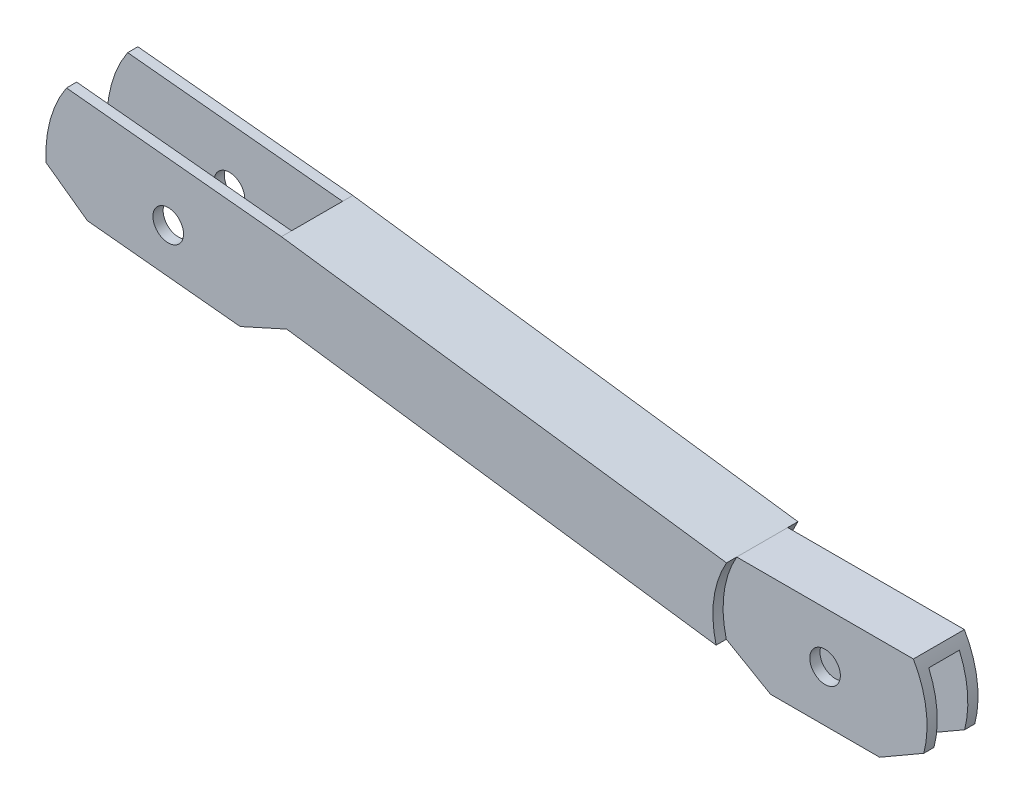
ISO-10303-21;
HEADER;
FILE_DESCRIPTION(('STEP AP214'),'2;1');
FILE_NAME('part.step','',(''),(''),'','','');
FILE_SCHEMA(('AUTOMOTIVE_DESIGN { 1 0 10303 214 1 1 1 1 }'));
ENDSEC;
DATA;
#1=APPLICATION_CONTEXT('core data for automotive mechanical design processes');
#2=APPLICATION_PROTOCOL_DEFINITION('international standard','automotive_design',2000,#1);
#3=PRODUCT_CONTEXT('',#1,'mechanical');
#4=PRODUCT('Part','Part','',(#3));
#5=PRODUCT_RELATED_PRODUCT_CATEGORY('part','',(#4));
#6=PRODUCT_DEFINITION_FORMATION('','',#4);
#7=PRODUCT_DEFINITION_CONTEXT('part definition',#1,'design');
#8=PRODUCT_DEFINITION('design','',#6,#7);
#9=PRODUCT_DEFINITION_SHAPE('','',#8);
#10=(LENGTH_UNIT() NAMED_UNIT(*) SI_UNIT(.MILLI.,.METRE.));
#11=(NAMED_UNIT(*) PLANE_ANGLE_UNIT() SI_UNIT($,.RADIAN.));
#12=(NAMED_UNIT(*) SI_UNIT($,.STERADIAN.) SOLID_ANGLE_UNIT());
#13=UNCERTAINTY_MEASURE_WITH_UNIT(LENGTH_MEASURE(1.E-05),#10,'distance_accuracy_value','');
#14=(GEOMETRIC_REPRESENTATION_CONTEXT(3) GLOBAL_UNCERTAINTY_ASSIGNED_CONTEXT((#13)) GLOBAL_UNIT_ASSIGNED_CONTEXT((#10,
#11,#12)) REPRESENTATION_CONTEXT('',''));
#15=CARTESIAN_POINT('',(0.,0.,0.));
#16=DIRECTION('',(0.,0.,1.));
#17=DIRECTION('',(1.,0.,0.));
#18=AXIS2_PLACEMENT_3D('',#15,#16,#17);
#19=CARTESIAN_POINT('',(-634.,63.,35.));
#20=DIRECTION('',(0.,0.,-1.));
#21=DIRECTION('',(-1.,0.,0.));
#22=AXIS2_PLACEMENT_3D('',#19,#20,#21);
#23=CYLINDRICAL_SURFACE('',#22,120.);
#24=CARTESIAN_POINT('',(-634.,63.,-25.));
#25=DIRECTION('',(0.,0.,1.));
#26=DIRECTION('',(1.,0.,0.));
#27=AXIS2_PLACEMENT_3D('',#24,#25,#26);
#28=CIRCLE('',#27,120.);
#29=CARTESIAN_POINT('',(-517.845006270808,32.8666724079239,-25.));
#30=VERTEX_POINT('',#29);
#31=CARTESIAN_POINT('',(-523.065336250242,108.754785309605,-25.));
#32=VERTEX_POINT('',#31);
#33=EDGE_CURVE('E73',#30,#32,#28,.T.);
#34=ORIENTED_EDGE('',*,*,#33,.F.);
#35=DIRECTION('',(0.,0.,-1.));
#36=VECTOR('',#35,1.);
#37=CARTESIAN_POINT('',(-517.845006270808,32.8666724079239,35.));
#38=LINE('',#37,#36);
#39=CARTESIAN_POINT('',(-517.845006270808,32.8666724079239,-35.));
#40=VERTEX_POINT('',#39);
#41=EDGE_CURVE('E47',#30,#40,#38,.T.);
#42=ORIENTED_EDGE('',*,*,#41,.T.);
#43=CARTESIAN_POINT('',(-634.,63.,-35.));
#44=DIRECTION('',(0.,0.,1.));
#45=DIRECTION('',(1.,0.,0.));
#46=AXIS2_PLACEMENT_3D('',#43,#44,#45);
#47=CIRCLE('',#46,120.);
#48=CARTESIAN_POINT('',(-523.065336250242,108.754785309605,-35.));
#49=VERTEX_POINT('',#48);
#50=EDGE_CURVE('E111',#40,#49,#47,.T.);
#51=ORIENTED_EDGE('',*,*,#50,.T.);
#52=DIRECTION('',(0.,0.,-1.));
#53=VECTOR('',#52,1.);
#54=CARTESIAN_POINT('',(-523.065336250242,108.754785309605,35.));
#55=LINE('',#54,#53);
#56=EDGE_CURVE('E103',#32,#49,#55,.T.);
#57=ORIENTED_EDGE('',*,*,#56,.F.);
#58=EDGE_LOOP('',(#34,#42,#51,#57));
#59=FACE_BOUND('',#58,.T.);
#60=ADVANCED_FACE('F43',(#59),#23,.T.);
#61=CARTESIAN_POINT('',(-733.76098725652,129.691419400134,35.));
#62=DIRECTION('',(-0.0988820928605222,-0.99509915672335,0.));
#63=DIRECTION('',(0.995099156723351,-0.0988820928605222,0.));
#64=AXIS2_PLACEMENT_3D('',#61,#62,#63);
#65=PLANE('',#64);
#66=DIRECTION('',(-0.99509915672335,0.0988820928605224,0.));
#67=VECTOR('',#66,1.);
#68=CARTESIAN_POINT('',(-733.76098725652,129.691419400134,-25.));
#69=LINE('',#68,#67);
#70=CARTESIAN_POINT('',(-733.76098725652,129.691419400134,-25.));
#71=VERTEX_POINT('',#70);
#72=EDGE_CURVE('E108',#32,#71,#69,.T.);
#73=ORIENTED_EDGE('',*,*,#72,.F.);
#74=ORIENTED_EDGE('',*,*,#56,.T.);
#75=DIRECTION('',(-0.99509915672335,0.0988820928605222,0.));
#76=VECTOR('',#75,1.);
#77=CARTESIAN_POINT('',(-733.76098725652,129.691419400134,-35.));
#78=LINE('',#77,#76);
#79=CARTESIAN_POINT('',(-733.76098725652,129.691419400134,-35.));
#80=VERTEX_POINT('',#79);
#81=EDGE_CURVE('E106',#49,#80,#78,.T.);
#82=ORIENTED_EDGE('',*,*,#81,.T.);
#83=DIRECTION('',(0.,0.,-1.));
#84=VECTOR('',#83,1.);
#85=CARTESIAN_POINT('',(-733.76098725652,129.691419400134,35.));
#86=LINE('',#85,#84);
#87=EDGE_CURVE('E98',#71,#80,#86,.T.);
#88=ORIENTED_EDGE('',*,*,#87,.F.);
#89=EDGE_LOOP('',(#73,#74,#82,#88));
#90=FACE_BOUND('',#89,.T.);
#91=ADVANCED_FACE('F105',(#90),#65,.F.);
#92=CARTESIAN_POINT('',(-634.,63.,35.));
#93=DIRECTION('',(0.,0.,-1.));
#94=DIRECTION('',(-1.,0.,0.));
#95=AXIS2_PLACEMENT_3D('',#92,#93,#94);
#96=CYLINDRICAL_SURFACE('',#95,120.);
#97=CARTESIAN_POINT('',(-634.,63.,-25.));
#98=DIRECTION('',(0.,0.,1.));
#99=DIRECTION('',(1.,0.,0.));
#100=AXIS2_PLACEMENT_3D('',#97,#98,#99);
#101=CIRCLE('',#100,120.);
#102=CARTESIAN_POINT('',(-753.813631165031,56.3146587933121,-25.));
#103=VERTEX_POINT('',#102);
#104=EDGE_CURVE('E53',#71,#103,#101,.T.);
#105=ORIENTED_EDGE('',*,*,#104,.F.);
#106=ORIENTED_EDGE('',*,*,#87,.T.);
#107=CARTESIAN_POINT('',(-634.,63.,-35.));
#108=DIRECTION('',(0.,0.,1.));
#109=DIRECTION('',(1.,0.,0.));
#110=AXIS2_PLACEMENT_3D('',#107,#108,#109);
#111=CIRCLE('',#110,120.);
#112=CARTESIAN_POINT('',(-753.813631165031,56.314658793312,-35.));
#113=VERTEX_POINT('',#112);
#114=EDGE_CURVE('E119',#80,#113,#111,.T.);
#115=ORIENTED_EDGE('',*,*,#114,.T.);
#116=DIRECTION('',(0.,0.,-1.));
#117=VECTOR('',#116,1.);
#118=CARTESIAN_POINT('',(-753.813631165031,56.314658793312,35.));
#119=LINE('',#118,#117);
#120=EDGE_CURVE('E139',#103,#113,#119,.T.);
#121=ORIENTED_EDGE('',*,*,#120,.F.);
#122=EDGE_LOOP('',(#105,#106,#115,#121));
#123=FACE_BOUND('',#122,.T.);
#124=ADVANCED_FACE('F155',(#123),#96,.T.);
#125=CARTESIAN_POINT('',(-713.196626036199,27.155459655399,35.));
#126=DIRECTION('',(0.583183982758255,0.812340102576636,0.));
#127=DIRECTION('',(-0.812340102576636,0.583183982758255,0.));
#128=AXIS2_PLACEMENT_3D('',#125,#126,#127);
#129=PLANE('',#128);
#130=DIRECTION('',(0.812340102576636,-0.583183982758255,0.));
#131=VECTOR('',#130,1.);
#132=CARTESIAN_POINT('',(-713.196626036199,27.155459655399,-25.));
#133=LINE('',#132,#131);
#134=CARTESIAN_POINT('',(-713.196626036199,27.155459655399,-25.));
#135=VERTEX_POINT('',#134);
#136=EDGE_CURVE('E12',#103,#135,#133,.T.);
#137=ORIENTED_EDGE('',*,*,#136,.F.);
#138=ORIENTED_EDGE('',*,*,#120,.T.);
#139=DIRECTION('',(0.812340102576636,-0.583183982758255,0.));
#140=VECTOR('',#139,1.);
#141=CARTESIAN_POINT('',(-713.196626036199,27.155459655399,-35.));
#142=LINE('',#141,#140);
#143=CARTESIAN_POINT('',(-713.196626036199,27.155459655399,-35.));
#144=VERTEX_POINT('',#143);
#145=EDGE_CURVE('E141',#113,#144,#142,.T.);
#146=ORIENTED_EDGE('',*,*,#145,.T.);
#147=DIRECTION('',(0.,0.,-1.));
#148=VECTOR('',#147,1.);
#149=CARTESIAN_POINT('',(-713.196626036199,27.155459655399,35.));
#150=LINE('',#149,#148);
#151=EDGE_CURVE('E142',#135,#144,#150,.T.);
#152=ORIENTED_EDGE('',*,*,#151,.F.);
#153=EDGE_LOOP('',(#137,#138,#146,#152));
#154=FACE_BOUND('',#153,.T.);
#155=ADVANCED_FACE('F158',(#154),#129,.F.);
#156=CARTESIAN_POINT('',(-713.196626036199,27.155459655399,35.));
#157=DIRECTION('',(0.0988820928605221,0.99509915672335,0.));
#158=DIRECTION('',(-0.995099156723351,0.0988820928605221,0.));
#159=AXIS2_PLACEMENT_3D('',#156,#157,#158);
#160=PLANE('',#159);
#161=DIRECTION('',(0.99509915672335,-0.0988820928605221,0.));
#162=VECTOR('',#161,1.);
#163=CARTESIAN_POINT('',(-713.196626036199,27.155459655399,-25.));
#164=LINE('',#163,#162);
#165=CARTESIAN_POINT('',(-563.406116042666,12.2709137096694,-25.));
#166=VERTEX_POINT('',#165);
#167=EDGE_CURVE('E80',#135,#166,#164,.T.);
#168=ORIENTED_EDGE('',*,*,#167,.F.);
#169=ORIENTED_EDGE('',*,*,#151,.T.);
#170=DIRECTION('',(0.99509915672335,-0.0988820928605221,0.));
#171=VECTOR('',#170,1.);
#172=CARTESIAN_POINT('',(-713.196626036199,27.155459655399,-35.));
#173=LINE('',#172,#171);
#174=CARTESIAN_POINT('',(-563.406116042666,12.2709137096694,-35.));
#175=VERTEX_POINT('',#174);
#176=EDGE_CURVE('E143',#144,#175,#173,.T.);
#177=ORIENTED_EDGE('',*,*,#176,.T.);
#178=DIRECTION('',(0.,0.,-1.));
#179=VECTOR('',#178,1.);
#180=CARTESIAN_POINT('',(-563.406116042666,12.2709137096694,35.));
#181=LINE('',#180,#179);
#182=EDGE_CURVE('E144',#166,#175,#181,.T.);
#183=ORIENTED_EDGE('',*,*,#182,.F.);
#184=EDGE_LOOP('',(#168,#169,#177,#183));
#185=FACE_BOUND('',#184,.T.);
#186=ADVANCED_FACE('F159',(#185),#160,.F.);
#187=CARTESIAN_POINT('',(-563.406116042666,12.2709137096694,35.));
#188=DIRECTION('',(-0.411915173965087,0.911222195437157,0.));
#189=DIRECTION('',(-0.911222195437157,-0.411915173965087,0.));
#190=AXIS2_PLACEMENT_3D('',#187,#188,#189);
#191=PLANE('',#190);
#192=DIRECTION('',(0.911222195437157,0.411915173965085,0.));
#193=VECTOR('',#192,1.);
#194=CARTESIAN_POINT('',(-563.406116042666,12.2709137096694,-25.));
#195=LINE('',#194,#193);
#196=EDGE_CURVE('E77',#166,#30,#195,.T.);
#197=ORIENTED_EDGE('',*,*,#196,.F.);
#198=ORIENTED_EDGE('',*,*,#182,.T.);
#199=DIRECTION('',(0.911222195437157,0.411915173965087,0.));
#200=VECTOR('',#199,1.);
#201=CARTESIAN_POINT('',(-563.406116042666,12.2709137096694,-35.));
#202=LINE('',#201,#200);
#203=EDGE_CURVE('E136',#175,#40,#202,.T.);
#204=ORIENTED_EDGE('',*,*,#203,.T.);
#205=ORIENTED_EDGE('',*,*,#41,.F.);
#206=EDGE_LOOP('',(#197,#198,#204,#205));
#207=FACE_BOUND('',#206,.T.);
#208=ADVANCED_FACE('F161',(#207),#191,.F.);
#209=CARTESIAN_POINT('',(-634.,63.,35.));
#210=DIRECTION('',(0.,0.,-1.));
#211=DIRECTION('',(-1.,0.,0.));
#212=AXIS2_PLACEMENT_3D('',#209,#210,#211);
#213=CYLINDRICAL_SURFACE('',#212,15.);
#214=CARTESIAN_POINT('',(-634.,63.,-35.));
#215=DIRECTION('',(0.,0.,1.));
#216=DIRECTION('',(1.,0.,0.));
#217=AXIS2_PLACEMENT_3D('',#214,#215,#216);
#218=CIRCLE('',#217,15.);
#219=CARTESIAN_POINT('',(-619.,63.,-35.));
#220=VERTEX_POINT('',#219);
#221=EDGE_CURVE('E126',#220,#220,#218,.T.);
#222=ORIENTED_EDGE('',*,*,#221,.F.);
#223=EDGE_LOOP('',(#222));
#224=FACE_BOUND('',#223,.T.);
#225=CARTESIAN_POINT('',(-634.,63.,-25.));
#226=DIRECTION('',(0.,0.,1.));
#227=DIRECTION('',(1.,0.,0.));
#228=AXIS2_PLACEMENT_3D('',#225,#226,#227);
#229=CIRCLE('',#228,15.);
#230=CARTESIAN_POINT('',(-619.,63.,-25.));
#231=VERTEX_POINT('',#230);
#232=EDGE_CURVE('E128',#231,#231,#229,.T.);
#233=ORIENTED_EDGE('',*,*,#232,.T.);
#234=EDGE_LOOP('',(#233));
#235=FACE_BOUND('',#234,.T.);
#236=ADVANCED_FACE('F45',(#224,#235),#213,.F.);
#237=CARTESIAN_POINT('',(-634.,63.,-35.));
#238=DIRECTION('',(0.,0.,1.));
#239=DIRECTION('',(1.,0.,0.));
#240=AXIS2_PLACEMENT_3D('',#237,#238,#239);
#241=PLANE('',#240);
#242=ORIENTED_EDGE('',*,*,#50,.F.);
#243=ORIENTED_EDGE('',*,*,#203,.F.);
#244=ORIENTED_EDGE('',*,*,#176,.F.);
#245=ORIENTED_EDGE('',*,*,#145,.F.);
#246=ORIENTED_EDGE('',*,*,#114,.F.);
#247=ORIENTED_EDGE('',*,*,#81,.F.);
#248=EDGE_LOOP('',(#242,#243,#244,#245,#246,#247));
#249=FACE_BOUND('',#248,.T.);
#250=ORIENTED_EDGE('',*,*,#221,.T.);
#251=EDGE_LOOP('',(#250));
#252=FACE_BOUND('',#251,.T.);
#253=ADVANCED_FACE('F115',(#249,#252),#241,.F.);
#254=CARTESIAN_POINT('',(-634.,63.,-25.));
#255=DIRECTION('',(0.,0.,1.));
#256=DIRECTION('',(1.,0.,0.));
#257=AXIS2_PLACEMENT_3D('',#254,#255,#256);
#258=PLANE('',#257);
#259=ORIENTED_EDGE('',*,*,#232,.F.);
#260=EDGE_LOOP('',(#259));
#261=FACE_BOUND('',#260,.T.);
#262=ORIENTED_EDGE('',*,*,#167,.T.);
#263=ORIENTED_EDGE('',*,*,#196,.T.);
#264=ORIENTED_EDGE('',*,*,#33,.T.);
#265=ORIENTED_EDGE('',*,*,#72,.T.);
#266=ORIENTED_EDGE('',*,*,#104,.T.);
#267=ORIENTED_EDGE('',*,*,#136,.T.);
#268=EDGE_LOOP('',(#262,#263,#264,#265,#266,#267));
#269=FACE_BOUND('',#268,.T.);
#270=ADVANCED_FACE('F211',(#261,#269),#258,.T.);
#271=CLOSED_SHELL('',(#60,#91,#124,#155,#186,#208,#236,#253,#270));
#272=MANIFOLD_SOLID_BREP('B2',#271);
#273=CARTESIAN_POINT('',(0.,0.,25.));
#274=DIRECTION('',(0.,0.,-1.));
#275=DIRECTION('',(-1.,0.,0.));
#276=AXIS2_PLACEMENT_3D('',#273,#274,#275);
#277=CYLINDRICAL_SURFACE('',#276,100.);
#278=DIRECTION('',(0.,0.,-1.));
#279=VECTOR('',#278,1.);
#280=CARTESIAN_POINT('',(-91.4066186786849,40.5565045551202,25.));
#281=LINE('',#280,#279);
#282=CARTESIAN_POINT('',(-91.4066186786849,40.5565045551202,14.));
#283=VERTEX_POINT('',#282);
#284=CARTESIAN_POINT('',(-91.4066186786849,40.5565045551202,-14.));
#285=VERTEX_POINT('',#284);
#286=EDGE_CURVE('E664',#283,#285,#281,.T.);
#287=ORIENTED_EDGE('',*,*,#286,.T.);
#288=CARTESIAN_POINT('',(0.,0.,-14.));
#289=DIRECTION('',(0.,0.,-1.));
#290=DIRECTION('',(-1.,0.,0.));
#291=AXIS2_PLACEMENT_3D('',#288,#289,#290);
#292=CIRCLE('',#291,100.);
#293=CARTESIAN_POINT('',(-91.6515138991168,40.,-14.));
#294=VERTEX_POINT('',#293);
#295=EDGE_CURVE('E703',#285,#294,#292,.F.);
#296=ORIENTED_EDGE('',*,*,#295,.T.);
#297=DIRECTION('',(0.,0.,1.));
#298=VECTOR('',#297,1.);
#299=CARTESIAN_POINT('',(-91.6515138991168,40.,-15.));
#300=LINE('',#299,#298);
#301=CARTESIAN_POINT('',(-91.6515138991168,40.,14.));
#302=VERTEX_POINT('',#301);
#303=EDGE_CURVE('E590',#294,#302,#300,.T.);
#304=ORIENTED_EDGE('',*,*,#303,.T.);
#305=CARTESIAN_POINT('',(0.,0.,14.));
#306=DIRECTION('',(0.,0.,1.));
#307=DIRECTION('',(1.,0.,0.));
#308=AXIS2_PLACEMENT_3D('',#305,#306,#307);
#309=CIRCLE('',#308,100.);
#310=EDGE_CURVE('E419',#302,#283,#309,.F.);
#311=ORIENTED_EDGE('',*,*,#310,.T.);
#312=EDGE_LOOP('',(#287,#296,#304,#311));
#313=FACE_BOUND('',#312,.T.);
#314=ADVANCED_FACE('F240',(#313),#277,.T.);
#315=CARTESIAN_POINT('',(-519.264334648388,98.1529102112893,25.));
#316=DIRECTION('',(0.133412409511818,0.991060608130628,0.));
#317=DIRECTION('',(-0.991060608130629,0.133412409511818,0.));
#318=AXIS2_PLACEMENT_3D('',#315,#316,#317);
#319=PLANE('',#318);
#320=DIRECTION('',(-0.991060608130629,0.133412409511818,0.));
#321=VECTOR('',#320,1.);
#322=CARTESIAN_POINT('',(-519.264334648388,98.1529102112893,-24.));
#323=LINE('',#322,#321);
#324=CARTESIAN_POINT('',(-101.690523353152,41.9408805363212,-24.));
#325=VERTEX_POINT('',#324);
#326=CARTESIAN_POINT('',(-519.264334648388,98.1529102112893,-24.));
#327=VERTEX_POINT('',#326);
#328=EDGE_CURVE('E498',#325,#327,#323,.T.);
#329=ORIENTED_EDGE('',*,*,#328,.F.);
#330=CARTESIAN_POINT('',(-101.690523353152,41.9408805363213,-24.));
#331=CARTESIAN_POINT('',(-101.393680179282,41.9009207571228,-24.000024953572));
#332=CARTESIAN_POINT('',(-101.096841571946,41.860961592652,-23.9874159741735));
#333=CARTESIAN_POINT('',(-100.505256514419,41.7813249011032,-23.9371519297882));
#334=CARTESIAN_POINT('',(-100.210510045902,41.7416473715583,-23.8994970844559));
#335=CARTESIAN_POINT('',(-99.6251504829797,41.6628487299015,-23.7993568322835));
#336=CARTESIAN_POINT('',(-99.334537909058,41.6237276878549,-23.7368683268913));
#337=CARTESIAN_POINT('',(-98.7595517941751,41.5463254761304,-23.5874589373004));
#338=CARTESIAN_POINT('',(-98.4751781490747,41.5080442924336,-23.5005384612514));
#339=CARTESIAN_POINT('',(-97.9145155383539,41.4325702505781,-23.3027215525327));
#340=CARTESIAN_POINT('',(-97.6382323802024,41.3953781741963,-23.1918083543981));
#341=CARTESIAN_POINT('',(-97.095989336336,41.3223836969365,-22.9467147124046));
#342=CARTESIAN_POINT('',(-96.8300295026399,41.2865813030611,-22.812534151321));
#343=CARTESIAN_POINT('',(-96.3105335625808,41.2166489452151,-22.5217801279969));
#344=CARTESIAN_POINT('',(-96.0569931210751,41.1825183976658,-22.3652145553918));
#345=CARTESIAN_POINT('',(-95.5642126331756,41.1161823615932,-22.0306363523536));
#346=CARTESIAN_POINT('',(-95.324972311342,41.0839768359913,-21.8526241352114));
#347=CARTESIAN_POINT('',(-94.8658369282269,41.0221699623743,-21.4788364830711));
#348=CARTESIAN_POINT('',(-94.6457245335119,40.9925393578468,-21.2833328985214));
#349=CARTESIAN_POINT('',(-94.2230940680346,40.93564662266,-20.873840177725));
#350=CARTESIAN_POINT('',(-94.0205753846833,40.9083844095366,-20.6598516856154));
#351=CARTESIAN_POINT('',(-93.6348162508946,40.856455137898,-20.214789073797));
#352=CARTESIAN_POINT('',(-93.4515789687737,40.8317885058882,-19.9837121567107));
#353=CARTESIAN_POINT('',(-93.1060532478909,40.7852752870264,-19.5061327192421));
#354=CARTESIAN_POINT('',(-92.9437637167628,40.7634285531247,-19.2596310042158));
#355=CARTESIAN_POINT('',(-92.6468515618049,40.7234594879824,-18.7617626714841));
#356=CARTESIAN_POINT('',(-92.511466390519,40.7052345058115,-18.5108588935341));
#357=CARTESIAN_POINT('',(-92.262826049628,40.6717635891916,-17.9981360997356));
#358=CARTESIAN_POINT('',(-92.1495695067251,40.6565174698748,-17.7363177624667));
#359=CARTESIAN_POINT('',(-91.9463224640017,40.6291572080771,-17.2039178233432));
#360=CARTESIAN_POINT('',(-91.8563100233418,40.6170401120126,-16.9333447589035));
#361=CARTESIAN_POINT('',(-91.7002952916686,40.5960380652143,-16.3853594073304));
#362=CARTESIAN_POINT('',(-91.6342844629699,40.5871519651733,-16.1079495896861));
#363=CARTESIAN_POINT('',(-91.5227721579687,40.5721406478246,-15.526916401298));
#364=CARTESIAN_POINT('',(-91.4792173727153,40.5662774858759,-15.2229066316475));
#365=CARTESIAN_POINT('',(-91.4356639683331,40.5604145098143,-14.7651122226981));
#366=CARTESIAN_POINT('',(-91.4247759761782,40.558948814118,-14.6123063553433));
#367=CARTESIAN_POINT('',(-91.4102532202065,40.5569938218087,-14.3063420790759));
#368=CARTESIAN_POINT('',(-91.4066185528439,40.55650453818,-14.1531836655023));
#369=CARTESIAN_POINT('',(-91.4066186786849,40.5565045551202,-14.));
#370=B_SPLINE_CURVE_WITH_KNOTS('',3,(#330,#331,#332,#333,#334,#335,#336,#337,#338,#339,#340,
#341,#342,#343,#344,#345,#346,#347,#348,#349,#350,#351,#352,#353,#354,#355,#356,#357,#358,#359,
#360,#361,#362,#363,#364,#365,#366,#367,#368,#369),.UNSPECIFIED.,.F.,.F.,(4,2,2,2,2,2,2,2,2,2,2,
2,2,2,2,2,2,2,2,4),(0.,0.898290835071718,1.7965737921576,2.69496886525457,3.5933489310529,
4.49235880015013,5.39137319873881,6.2900715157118,7.18875251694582,8.07531708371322,
8.96185076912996,9.84852990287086,10.7351627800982,11.5911419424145,12.4470679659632,
13.3021830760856,14.1569937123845,15.0769574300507,15.5364081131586,15.9958649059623),.UNSPECIFIED.);
#371=EDGE_CURVE('E458',#325,#285,#370,.T.);
#372=ORIENTED_EDGE('',*,*,#371,.T.);
#373=ORIENTED_EDGE('',*,*,#286,.F.);
#374=CARTESIAN_POINT('',(-91.4066186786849,40.5565045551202,14.));
#375=CARTESIAN_POINT('',(-91.4065810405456,40.5564994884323,14.2733613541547));
#376=CARTESIAN_POINT('',(-91.4181886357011,40.558062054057,14.5467137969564));
#377=CARTESIAN_POINT('',(-91.4644195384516,40.5642854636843,15.0913939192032));
#378=CARTESIAN_POINT('',(-91.4990397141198,40.56894588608,15.3627218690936));
#379=CARTESIAN_POINT('',(-91.5909331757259,40.5813161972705,15.9009062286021));
#380=CARTESIAN_POINT('',(-91.6481629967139,40.5890202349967,16.1677701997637));
#381=CARTESIAN_POINT('',(-91.7847530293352,40.6074074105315,16.695665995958));
#382=CARTESIAN_POINT('',(-91.8641133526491,40.6180905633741,16.9566977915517));
#383=CARTESIAN_POINT('',(-92.0442720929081,40.6423427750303,17.4711151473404));
#384=CARTESIAN_POINT('',(-92.1450706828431,40.6559118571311,17.7245006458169));
#385=CARTESIAN_POINT('',(-92.3672475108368,40.6858203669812,18.2219186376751));
#386=CARTESIAN_POINT('',(-92.4886265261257,40.702159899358,18.4659507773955));
#387=CARTESIAN_POINT('',(-92.7509710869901,40.7374756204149,18.9430797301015));
#388=CARTESIAN_POINT('',(-92.8919388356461,40.7564521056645,19.1761753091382));
#389=CARTESIAN_POINT('',(-93.1923221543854,40.7968884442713,19.6299276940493));
#390=CARTESIAN_POINT('',(-93.3517379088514,40.8183483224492,19.8505843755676));
#391=CARTESIAN_POINT('',(-93.6908029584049,40.8639918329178,20.2819480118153));
#392=CARTESIAN_POINT('',(-93.8707638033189,40.8882174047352,20.4924056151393));
#393=CARTESIAN_POINT('',(-94.2472024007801,40.9388919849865,20.8978194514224));
#394=CARTESIAN_POINT('',(-94.4436854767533,40.9653417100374,21.092770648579));
#395=CARTESIAN_POINT('',(-94.8516767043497,41.0202637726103,21.4659646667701));
#396=CARTESIAN_POINT('',(-95.0631856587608,41.0487362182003,21.6442065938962));
#397=CARTESIAN_POINT('',(-95.4997168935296,41.1075002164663,21.9829652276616));
#398=CARTESIAN_POINT('',(-95.7247396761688,41.1377918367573,22.143481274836));
#399=CARTESIAN_POINT('',(-96.195431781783,41.2011544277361,22.4515835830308));
#400=CARTESIAN_POINT('',(-96.4415591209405,41.2342870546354,22.5984578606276));
#401=CARTESIAN_POINT('',(-96.9448509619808,41.3020380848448,22.8712796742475));
#402=CARTESIAN_POINT('',(-97.2020123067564,41.3366560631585,22.9972331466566));
#403=CARTESIAN_POINT('',(-97.7256878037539,41.4071510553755,23.2275627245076));
#404=CARTESIAN_POINT('',(-97.9922025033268,41.4430281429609,23.331937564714));
#405=CARTESIAN_POINT('',(-98.5326478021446,41.5157806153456,23.5184923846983));
#406=CARTESIAN_POINT('',(-98.8065772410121,41.5526558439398,23.6006758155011));
#407=CARTESIAN_POINT('',(-99.5092010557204,41.6472401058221,23.7805439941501));
#408=CARTESIAN_POINT('',(-99.9419208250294,41.7054910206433,23.8628065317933));
#409=CARTESIAN_POINT('',(-100.595434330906,41.7934642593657,23.9450906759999));
#410=CARTESIAN_POINT('',(-100.813910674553,41.8228746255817,23.9656670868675));
#411=CARTESIAN_POINT('',(-101.251741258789,41.8818135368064,23.9931201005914));
#412=CARTESIAN_POINT('',(-101.471095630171,41.9113420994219,23.9999945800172));
#413=CARTESIAN_POINT('',(-101.690523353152,41.9408805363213,24.));
#414=B_SPLINE_CURVE_WITH_KNOTS('',3,(#374,#375,#376,#377,#378,#379,#380,#381,#382,#383,#384,
#385,#386,#387,#388,#389,#390,#391,#392,#393,#394,#395,#396,#397,#398,#399,#400,#401,#402,#403,
#404,#405,#406,#407,#408,#409,#410,#411,#412,#413),.UNSPECIFIED.,.F.,.F.,(4,2,2,2,2,2,2,2,2,2,2,
2,2,2,2,2,2,2,2,4),(0.,0.8198198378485,1.63952812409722,2.45766820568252,3.27581241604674,
4.09396322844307,4.91214494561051,5.73041875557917,6.54870074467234,7.38165521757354,
8.21487910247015,9.0481475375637,9.88144696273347,10.7460415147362,11.6103903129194,
12.4747897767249,13.3390547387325,14.667990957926,15.3318549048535,15.9958217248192),.UNSPECIFIED.);
#415=CARTESIAN_POINT('',(-101.690523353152,41.9408805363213,24.));
#416=VERTEX_POINT('',#415);
#417=EDGE_CURVE('E490',#283,#416,#414,.T.);
#418=ORIENTED_EDGE('',*,*,#417,.T.);
#419=DIRECTION('',(-0.991060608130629,0.133412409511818,0.));
#420=VECTOR('',#419,1.);
#421=CARTESIAN_POINT('',(3.73543764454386,27.748881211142,24.));
#422=LINE('',#421,#420);
#423=CARTESIAN_POINT('',(-519.264334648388,98.1529102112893,24.));
#424=VERTEX_POINT('',#423);
#425=EDGE_CURVE('E501',#416,#424,#422,.T.);
#426=ORIENTED_EDGE('',*,*,#425,.T.);
#427=DIRECTION('',(0.,0.,-1.));
#428=VECTOR('',#427,1.);
#429=CARTESIAN_POINT('',(-519.264334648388,98.1529102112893,25.));
#430=LINE('',#429,#428);
#431=EDGE_CURVE('E650',#424,#327,#430,.T.);
#432=ORIENTED_EDGE('',*,*,#431,.T.);
#433=EDGE_LOOP('',(#329,#372,#373,#418,#426,#432));
#434=FACE_BOUND('',#433,.T.);
#435=ADVANCED_FACE('F484',(#434),#319,.F.);
#436=CARTESIAN_POINT('',(0.,0.,-25.));
#437=DIRECTION('',(0.,0.,1.));
#438=DIRECTION('',(1.,0.,0.));
#439=AXIS2_PLACEMENT_3D('',#436,#437,#438);
#440=PLANE('',#439);
#441=CARTESIAN_POINT('',(0.,0.,-25.));
#442=DIRECTION('',(0.,0.,1.));
#443=DIRECTION('',(1.,0.,0.));
#444=AXIS2_PLACEMENT_3D('',#441,#442,#443);
#445=CIRCLE('',#444,15.);
#446=CARTESIAN_POINT('',(15.,0.,-25.));
#447=VERTEX_POINT('',#446);
#448=EDGE_CURVE('E586',#447,#447,#445,.T.);
#449=ORIENTED_EDGE('',*,*,#448,.T.);
#450=EDGE_LOOP('',(#449));
#451=FACE_BOUND('',#450,.T.);
#452=CARTESIAN_POINT('',(0.,0.,-25.));
#453=DIRECTION('',(0.,0.,1.));
#454=DIRECTION('',(1.,0.,0.));
#455=AXIS2_PLACEMENT_3D('',#452,#453,#454);
#456=CIRCLE('',#455,100.);
#457=CARTESIAN_POINT('',(-86.6025403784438,50.,-25.));
#458=VERTEX_POINT('',#457);
#459=CARTESIAN_POINT('',(-96.8245836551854,-25.,-25.));
#460=VERTEX_POINT('',#459);
#461=EDGE_CURVE('E621',#458,#460,#456,.T.);
#462=ORIENTED_EDGE('',*,*,#461,.F.);
#463=DIRECTION('',(-1.,0.,0.));
#464=VECTOR('',#463,1.);
#465=CARTESIAN_POINT('',(-86.6025403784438,50.,-25.));
#466=LINE('',#465,#464);
#467=CARTESIAN_POINT('',(86.6025403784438,50.,-25.));
#468=VERTEX_POINT('',#467);
#469=EDGE_CURVE('E606',#468,#458,#466,.T.);
#470=ORIENTED_EDGE('',*,*,#469,.F.);
#471=CARTESIAN_POINT('',(0.,0.,-25.));
#472=DIRECTION('',(0.,0.,1.));
#473=DIRECTION('',(1.,0.,0.));
#474=AXIS2_PLACEMENT_3D('',#471,#472,#473);
#475=CIRCLE('',#474,100.);
#476=CARTESIAN_POINT('',(96.8245836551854,-25.,-25.));
#477=VERTEX_POINT('',#476);
#478=EDGE_CURVE('E610',#477,#468,#475,.T.);
#479=ORIENTED_EDGE('',*,*,#478,.F.);
#480=DIRECTION('',(0.866025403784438,0.500000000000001,0.));
#481=VECTOR('',#480,1.);
#482=CARTESIAN_POINT('',(96.8245836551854,-25.,-25.));
#483=LINE('',#482,#481);
#484=CARTESIAN_POINT('',(53.5233134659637,-50.,-25.));
#485=VERTEX_POINT('',#484);
#486=EDGE_CURVE('E612',#485,#477,#483,.T.);
#487=ORIENTED_EDGE('',*,*,#486,.F.);
#488=DIRECTION('',(1.,0.,0.));
#489=VECTOR('',#488,1.);
#490=CARTESIAN_POINT('',(-53.5233134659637,-50.,-25.));
#491=LINE('',#490,#489);
#492=CARTESIAN_POINT('',(-53.5233134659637,-50.,-25.));
#493=VERTEX_POINT('',#492);
#494=EDGE_CURVE('E615',#493,#485,#491,.T.);
#495=ORIENTED_EDGE('',*,*,#494,.F.);
#496=DIRECTION('',(0.866025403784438,-0.500000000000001,0.));
#497=VECTOR('',#496,1.);
#498=CARTESIAN_POINT('',(-96.8245836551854,-25.,-25.));
#499=LINE('',#498,#497);
#500=EDGE_CURVE('E618',#460,#493,#499,.T.);
#501=ORIENTED_EDGE('',*,*,#500,.F.);
#502=EDGE_LOOP('',(#462,#470,#479,#487,#495,#501));
#503=FACE_BOUND('',#502,.T.);
#504=ADVANCED_FACE('F487',(#451,#503),#440,.F.);
#505=CARTESIAN_POINT('',(0.,0.,24.));
#506=DIRECTION('',(0.,0.,1.));
#507=DIRECTION('',(1.,0.,0.));
#508=AXIS2_PLACEMENT_3D('',#505,#506,#507);
#509=PLANE('',#508);
#510=ORIENTED_EDGE('',*,*,#425,.F.);
#511=CARTESIAN_POINT('',(0.,0.,24.));
#512=DIRECTION('',(0.,0.,1.));
#513=DIRECTION('',(1.,0.,0.));
#514=AXIS2_PLACEMENT_3D('',#511,#512,#513);
#515=CIRCLE('',#514,110.);
#516=CARTESIAN_POINT('',(-107.451845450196,-23.5393481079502,24.));
#517=VERTEX_POINT('',#516);
#518=EDGE_CURVE('E444',#416,#517,#515,.T.);
#519=ORIENTED_EDGE('',*,*,#518,.T.);
#520=DIRECTION('',(0.990686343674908,-0.136163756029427,0.));
#521=VECTOR('',#520,1.);
#522=CARTESIAN_POINT('',(-517.845006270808,32.8666724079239,24.));
#523=LINE('',#522,#521);
#524=CARTESIAN_POINT('',(-517.845006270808,32.8666724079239,24.));
#525=VERTEX_POINT('',#524);
#526=EDGE_CURVE('E578',#525,#517,#523,.T.);
#527=ORIENTED_EDGE('',*,*,#526,.F.);
#528=CARTESIAN_POINT('',(-634.,63.,24.));
#529=DIRECTION('',(0.,0.,-1.));
#530=DIRECTION('',(1.,0.,0.));
#531=AXIS2_PLACEMENT_3D('',#528,#529,#530);
#532=CIRCLE('',#531,120.);
#533=EDGE_CURVE('E570',#424,#525,#532,.T.);
#534=ORIENTED_EDGE('',*,*,#533,.F.);
#535=EDGE_LOOP('',(#510,#519,#527,#534));
#536=FACE_BOUND('',#535,.T.);
#537=ADVANCED_FACE('F710',(#536),#509,.F.);
#538=CARTESIAN_POINT('',(-563.406116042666,12.2709137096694,35.));
#539=DIRECTION('',(-0.411915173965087,0.911222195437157,0.));
#540=DIRECTION('',(-0.911222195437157,-0.411915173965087,0.));
#541=AXIS2_PLACEMENT_3D('',#538,#539,#540);
#542=PLANE('',#541);
#543=DIRECTION('',(0.,0.,-1.));
#544=VECTOR('',#543,1.);
#545=CARTESIAN_POINT('',(-563.406116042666,12.2709137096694,35.));
#546=LINE('',#545,#544);
#547=CARTESIAN_POINT('',(-563.406116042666,12.2709137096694,35.));
#548=VERTEX_POINT('',#547);
#549=CARTESIAN_POINT('',(-563.406116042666,12.2709137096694,25.));
#550=VERTEX_POINT('',#549);
#551=EDGE_CURVE('E515',#548,#550,#546,.T.);
#552=ORIENTED_EDGE('',*,*,#551,.T.);
#553=DIRECTION('',(0.911222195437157,0.411915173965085,0.));
#554=VECTOR('',#553,1.);
#555=CARTESIAN_POINT('',(-563.406116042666,12.2709137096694,25.));
#556=LINE('',#555,#554);
#557=CARTESIAN_POINT('',(-517.845006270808,32.8666724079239,25.));
#558=VERTEX_POINT('',#557);
#559=EDGE_CURVE('E546',#550,#558,#556,.T.);
#560=ORIENTED_EDGE('',*,*,#559,.T.);
#561=DIRECTION('',(0.,0.,-1.));
#562=VECTOR('',#561,1.);
#563=CARTESIAN_POINT('',(-517.845006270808,32.8666724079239,35.));
#564=LINE('',#563,#562);
#565=CARTESIAN_POINT('',(-517.845006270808,32.8666724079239,35.));
#566=VERTEX_POINT('',#565);
#567=EDGE_CURVE('E518',#566,#558,#564,.T.);
#568=ORIENTED_EDGE('',*,*,#567,.F.);
#569=DIRECTION('',(0.911222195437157,0.411915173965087,0.));
#570=VECTOR('',#569,1.);
#571=CARTESIAN_POINT('',(-563.406116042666,12.2709137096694,35.));
#572=LINE('',#571,#570);
#573=EDGE_CURVE('E521',#548,#566,#572,.T.);
#574=ORIENTED_EDGE('',*,*,#573,.F.);
#575=EDGE_LOOP('',(#552,#560,#568,#574));
#576=FACE_BOUND('',#575,.T.);
#577=ADVANCED_FACE('F759',(#576),#542,.F.);
#578=CARTESIAN_POINT('',(-713.196626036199,27.155459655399,35.));
#579=DIRECTION('',(0.0988820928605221,0.99509915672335,0.));
#580=DIRECTION('',(-0.995099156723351,0.0988820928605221,0.));
#581=AXIS2_PLACEMENT_3D('',#578,#579,#580);
#582=PLANE('',#581);
#583=DIRECTION('',(0.,0.,-1.));
#584=VECTOR('',#583,1.);
#585=CARTESIAN_POINT('',(-713.196626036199,27.155459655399,35.));
#586=LINE('',#585,#584);
#587=CARTESIAN_POINT('',(-713.196626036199,27.155459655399,35.));
#588=VERTEX_POINT('',#587);
#589=CARTESIAN_POINT('',(-713.196626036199,27.155459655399,25.));
#590=VERTEX_POINT('',#589);
#591=EDGE_CURVE('E512',#588,#590,#586,.T.);
#592=ORIENTED_EDGE('',*,*,#591,.T.);
#593=DIRECTION('',(0.99509915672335,-0.0988820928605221,0.));
#594=VECTOR('',#593,1.);
#595=CARTESIAN_POINT('',(-713.196626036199,27.155459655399,25.));
#596=LINE('',#595,#594);
#597=EDGE_CURVE('E549',#590,#550,#596,.T.);
#598=ORIENTED_EDGE('',*,*,#597,.T.);
#599=ORIENTED_EDGE('',*,*,#551,.F.);
#600=DIRECTION('',(0.99509915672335,-0.0988820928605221,0.));
#601=VECTOR('',#600,1.);
#602=CARTESIAN_POINT('',(-713.196626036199,27.155459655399,35.));
#603=LINE('',#602,#601);
#604=EDGE_CURVE('E523',#588,#548,#603,.T.);
#605=ORIENTED_EDGE('',*,*,#604,.F.);
#606=EDGE_LOOP('',(#592,#598,#599,#605));
#607=FACE_BOUND('',#606,.T.);
#608=ADVANCED_FACE('F764',(#607),#582,.F.);
#609=CARTESIAN_POINT('',(-713.196626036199,27.155459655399,35.));
#610=DIRECTION('',(0.583183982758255,0.812340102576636,0.));
#611=DIRECTION('',(-0.812340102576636,0.583183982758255,0.));
#612=AXIS2_PLACEMENT_3D('',#609,#610,#611);
#613=PLANE('',#612);
#614=DIRECTION('',(0.,0.,-1.));
#615=VECTOR('',#614,1.);
#616=CARTESIAN_POINT('',(-753.813631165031,56.314658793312,35.));
#617=LINE('',#616,#615);
#618=CARTESIAN_POINT('',(-753.813631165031,56.314658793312,35.));
#619=VERTEX_POINT('',#618);
#620=CARTESIAN_POINT('',(-753.813631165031,56.3146587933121,25.));
#621=VERTEX_POINT('',#620);
#622=EDGE_CURVE('E509',#619,#621,#617,.T.);
#623=ORIENTED_EDGE('',*,*,#622,.T.);
#624=DIRECTION('',(0.812340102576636,-0.583183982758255,0.));
#625=VECTOR('',#624,1.);
#626=CARTESIAN_POINT('',(-713.196626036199,27.155459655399,25.));
#627=LINE('',#626,#625);
#628=EDGE_CURVE('E534',#621,#590,#627,.T.);
#629=ORIENTED_EDGE('',*,*,#628,.T.);
#630=ORIENTED_EDGE('',*,*,#591,.F.);
#631=DIRECTION('',(0.812340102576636,-0.583183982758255,0.));
#632=VECTOR('',#631,1.);
#633=CARTESIAN_POINT('',(-713.196626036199,27.155459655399,35.));
#634=LINE('',#633,#632);
#635=EDGE_CURVE('E525',#619,#588,#634,.T.);
#636=ORIENTED_EDGE('',*,*,#635,.F.);
#637=EDGE_LOOP('',(#623,#629,#630,#636));
#638=FACE_BOUND('',#637,.T.);
#639=ADVANCED_FACE('F768',(#638),#613,.F.);
#640=CARTESIAN_POINT('',(-634.,63.,35.));
#641=DIRECTION('',(0.,0.,-1.));
#642=DIRECTION('',(-1.,0.,0.));
#643=AXIS2_PLACEMENT_3D('',#640,#641,#642);
#644=CYLINDRICAL_SURFACE('',#643,120.);
#645=DIRECTION('',(0.,0.,-1.));
#646=VECTOR('',#645,1.);
#647=CARTESIAN_POINT('',(-733.76098725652,129.691419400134,35.));
#648=LINE('',#647,#646);
#649=CARTESIAN_POINT('',(-733.76098725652,129.691419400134,35.));
#650=VERTEX_POINT('',#649);
#651=CARTESIAN_POINT('',(-733.76098725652,129.691419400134,25.));
#652=VERTEX_POINT('',#651);
#653=EDGE_CURVE('E506',#650,#652,#648,.T.);
#654=ORIENTED_EDGE('',*,*,#653,.T.);
#655=CARTESIAN_POINT('',(-634.,63.,25.));
#656=DIRECTION('',(0.,0.,1.));
#657=DIRECTION('',(1.,0.,0.));
#658=AXIS2_PLACEMENT_3D('',#655,#656,#657);
#659=CIRCLE('',#658,120.);
#660=EDGE_CURVE('E537',#652,#621,#659,.T.);
#661=ORIENTED_EDGE('',*,*,#660,.T.);
#662=ORIENTED_EDGE('',*,*,#622,.F.);
#663=CARTESIAN_POINT('',(-634.,63.,35.));
#664=DIRECTION('',(0.,0.,1.));
#665=DIRECTION('',(1.,0.,0.));
#666=AXIS2_PLACEMENT_3D('',#663,#664,#665);
#667=CIRCLE('',#666,120.);
#668=EDGE_CURVE('E527',#650,#619,#667,.T.);
#669=ORIENTED_EDGE('',*,*,#668,.F.);
#670=EDGE_LOOP('',(#654,#661,#662,#669));
#671=FACE_BOUND('',#670,.T.);
#672=ADVANCED_FACE('F771',(#671),#644,.T.);
#673=CARTESIAN_POINT('',(-733.76098725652,129.691419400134,35.));
#674=DIRECTION('',(-0.0988820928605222,-0.99509915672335,0.));
#675=DIRECTION('',(0.995099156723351,-0.0988820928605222,0.));
#676=AXIS2_PLACEMENT_3D('',#673,#674,#675);
#677=PLANE('',#676);
#678=DIRECTION('',(0.,0.,-1.));
#679=VECTOR('',#678,1.);
#680=CARTESIAN_POINT('',(-523.065336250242,108.754785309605,35.));
#681=LINE('',#680,#679);
#682=CARTESIAN_POINT('',(-523.065336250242,108.754785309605,35.));
#683=VERTEX_POINT('',#682);
#684=CARTESIAN_POINT('',(-523.065336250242,108.754785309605,25.));
#685=VERTEX_POINT('',#684);
#686=EDGE_CURVE('E503',#683,#685,#681,.T.);
#687=ORIENTED_EDGE('',*,*,#686,.T.);
#688=DIRECTION('',(-0.99509915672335,0.0988820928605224,0.));
#689=VECTOR('',#688,1.);
#690=CARTESIAN_POINT('',(-733.76098725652,129.691419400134,25.));
#691=LINE('',#690,#689);
#692=EDGE_CURVE('E540',#685,#652,#691,.T.);
#693=ORIENTED_EDGE('',*,*,#692,.T.);
#694=ORIENTED_EDGE('',*,*,#653,.F.);
#695=DIRECTION('',(-0.99509915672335,0.0988820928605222,0.));
#696=VECTOR('',#695,1.);
#697=CARTESIAN_POINT('',(-733.76098725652,129.691419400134,35.));
#698=LINE('',#697,#696);
#699=EDGE_CURVE('E529',#683,#650,#698,.T.);
#700=ORIENTED_EDGE('',*,*,#699,.F.);
#701=EDGE_LOOP('',(#687,#693,#694,#700));
#702=FACE_BOUND('',#701,.T.);
#703=ADVANCED_FACE('F453',(#702),#677,.F.);
#704=CARTESIAN_POINT('',(-634.,63.,35.));
#705=DIRECTION('',(0.,0.,1.));
#706=DIRECTION('',(1.,0.,0.));
#707=AXIS2_PLACEMENT_3D('',#704,#705,#706);
#708=PLANE('',#707);
#709=ORIENTED_EDGE('',*,*,#573,.T.);
#710=DIRECTION('',(0.990686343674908,-0.136163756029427,0.));
#711=VECTOR('',#710,1.);
#712=CARTESIAN_POINT('',(-517.845006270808,32.8666724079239,35.));
#713=LINE('',#712,#711);
#714=CARTESIAN_POINT('',(-96.8245836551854,-25.,35.));
#715=VERTEX_POINT('',#714);
#716=EDGE_CURVE('E567',#566,#715,#713,.T.);
#717=ORIENTED_EDGE('',*,*,#716,.T.);
#718=CARTESIAN_POINT('',(0.,0.,35.));
#719=DIRECTION('',(0.,0.,-1.));
#720=DIRECTION('',(1.,0.,0.));
#721=AXIS2_PLACEMENT_3D('',#718,#719,#720);
#722=CIRCLE('',#721,100.);
#723=CARTESIAN_POINT('',(-86.6025403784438,50.,35.));
#724=VERTEX_POINT('',#723);
#725=EDGE_CURVE('E574',#715,#724,#722,.T.);
#726=ORIENTED_EDGE('',*,*,#725,.T.);
#727=DIRECTION('',(-0.991060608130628,0.133412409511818,0.));
#728=VECTOR('',#727,1.);
#729=CARTESIAN_POINT('',(-86.6025403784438,50.,35.));
#730=LINE('',#729,#728);
#731=EDGE_CURVE('E571',#724,#683,#730,.T.);
#732=ORIENTED_EDGE('',*,*,#731,.T.);
#733=ORIENTED_EDGE('',*,*,#699,.T.);
#734=ORIENTED_EDGE('',*,*,#668,.T.);
#735=ORIENTED_EDGE('',*,*,#635,.T.);
#736=ORIENTED_EDGE('',*,*,#604,.T.);
#737=EDGE_LOOP('',(#709,#717,#726,#732,#733,#734,#735,#736));
#738=FACE_BOUND('',#737,.T.);
#739=CARTESIAN_POINT('',(-634.,63.,35.));
#740=DIRECTION('',(0.,0.,1.));
#741=DIRECTION('',(1.,0.,0.));
#742=AXIS2_PLACEMENT_3D('',#739,#740,#741);
#743=CIRCLE('',#742,15.);
#744=CARTESIAN_POINT('',(-619.,63.,35.));
#745=VERTEX_POINT('',#744);
#746=EDGE_CURVE('E531',#745,#745,#743,.T.);
#747=ORIENTED_EDGE('',*,*,#746,.F.);
#748=EDGE_LOOP('',(#747));
#749=FACE_BOUND('',#748,.T.);
#750=ADVANCED_FACE('F753',(#738,#749),#708,.T.);
#751=CARTESIAN_POINT('',(-634.,63.,35.));
#752=DIRECTION('',(0.,0.,-1.));
#753=DIRECTION('',(-1.,0.,0.));
#754=AXIS2_PLACEMENT_3D('',#751,#752,#753);
#755=CYLINDRICAL_SURFACE('',#754,15.);
#756=CARTESIAN_POINT('',(-634.,63.,25.));
#757=DIRECTION('',(0.,0.,1.));
#758=DIRECTION('',(1.,0.,0.));
#759=AXIS2_PLACEMENT_3D('',#756,#757,#758);
#760=CIRCLE('',#759,15.);
#761=CARTESIAN_POINT('',(-619.,63.,25.));
#762=VERTEX_POINT('',#761);
#763=EDGE_CURVE('E552',#762,#762,#760,.T.);
#764=ORIENTED_EDGE('',*,*,#763,.F.);
#765=EDGE_LOOP('',(#764));
#766=FACE_BOUND('',#765,.T.);
#767=ORIENTED_EDGE('',*,*,#746,.T.);
#768=EDGE_LOOP('',(#767));
#769=FACE_BOUND('',#768,.T.);
#770=ADVANCED_FACE('F822',(#766,#769),#755,.F.);
#771=CARTESIAN_POINT('',(-634.,63.,25.));
#772=DIRECTION('',(0.,0.,1.));
#773=DIRECTION('',(1.,0.,0.));
#774=AXIS2_PLACEMENT_3D('',#771,#772,#773);
#775=PLANE('',#774);
#776=ORIENTED_EDGE('',*,*,#763,.T.);
#777=EDGE_LOOP('',(#776));
#778=FACE_BOUND('',#777,.T.);
#779=ORIENTED_EDGE('',*,*,#597,.F.);
#780=ORIENTED_EDGE('',*,*,#628,.F.);
#781=ORIENTED_EDGE('',*,*,#660,.F.);
#782=ORIENTED_EDGE('',*,*,#692,.F.);
#783=CARTESIAN_POINT('',(-634.,63.,25.));
#784=DIRECTION('',(0.,0.,1.));
#785=DIRECTION('',(1.,0.,0.));
#786=AXIS2_PLACEMENT_3D('',#783,#784,#785);
#787=CIRCLE('',#786,120.);
#788=EDGE_CURVE('E543',#558,#685,#787,.T.);
#789=ORIENTED_EDGE('',*,*,#788,.F.);
#790=ORIENTED_EDGE('',*,*,#559,.F.);
#791=EDGE_LOOP('',(#779,#780,#781,#782,#789,#790));
#792=FACE_BOUND('',#791,.T.);
#793=ADVANCED_FACE('F761',(#778,#792),#775,.F.);
#794=CARTESIAN_POINT('',(-634.,63.,24.));
#795=DIRECTION('',(0.,0.,1.));
#796=DIRECTION('',(1.,0.,0.));
#797=AXIS2_PLACEMENT_3D('',#794,#795,#796);
#798=CYLINDRICAL_SURFACE('',#797,120.);
#799=CARTESIAN_POINT('',(-634.,63.,-24.));
#800=DIRECTION('',(0.,0.,-1.));
#801=DIRECTION('',(1.,0.,0.));
#802=AXIS2_PLACEMENT_3D('',#799,#800,#801);
#803=CIRCLE('',#802,120.);
#804=CARTESIAN_POINT('',(-517.845006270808,32.8666724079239,-24.));
#805=VERTEX_POINT('',#804);
#806=EDGE_CURVE('E688',#327,#805,#803,.T.);
#807=ORIENTED_EDGE('',*,*,#806,.F.);
#808=ORIENTED_EDGE('',*,*,#431,.F.);
#809=ORIENTED_EDGE('',*,*,#533,.T.);
#810=DIRECTION('',(0.,0.,1.));
#811=VECTOR('',#810,1.);
#812=CARTESIAN_POINT('',(-517.845006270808,32.8666724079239,24.));
#813=LINE('',#812,#811);
#814=EDGE_CURVE('E561',#525,#558,#813,.T.);
#815=ORIENTED_EDGE('',*,*,#814,.T.);
#816=ORIENTED_EDGE('',*,*,#788,.T.);
#817=DIRECTION('',(0.,0.,1.));
#818=VECTOR('',#817,1.);
#819=CARTESIAN_POINT('',(-523.065336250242,108.754785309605,24.));
#820=LINE('',#819,#818);
#821=CARTESIAN_POINT('',(-523.065336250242,108.754785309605,-35.));
#822=VERTEX_POINT('',#821);
#823=EDGE_CURVE('E558',#822,#685,#820,.T.);
#824=ORIENTED_EDGE('',*,*,#823,.F.);
#825=CARTESIAN_POINT('',(-634.,63.,-35.));
#826=DIRECTION('',(0.,0.,-1.));
#827=DIRECTION('',(1.,0.,0.));
#828=AXIS2_PLACEMENT_3D('',#825,#826,#827);
#829=CIRCLE('',#828,120.);
#830=CARTESIAN_POINT('',(-517.845006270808,32.8666724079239,-35.));
#831=VERTEX_POINT('',#830);
#832=EDGE_CURVE('E679',#822,#831,#829,.T.);
#833=ORIENTED_EDGE('',*,*,#832,.T.);
#834=DIRECTION('',(0.,0.,-1.));
#835=VECTOR('',#834,1.);
#836=CARTESIAN_POINT('',(-517.845006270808,32.8666724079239,-24.));
#837=LINE('',#836,#835);
#838=EDGE_CURVE('E669',#805,#831,#837,.T.);
#839=ORIENTED_EDGE('',*,*,#838,.F.);
#840=EDGE_LOOP('',(#807,#808,#809,#815,#816,#824,#833,#839));
#841=FACE_BOUND('',#840,.T.);
#842=ADVANCED_FACE('F717',(#841),#798,.F.);
#843=CARTESIAN_POINT('',(0.,0.,24.));
#844=DIRECTION('',(0.,0.,1.));
#845=DIRECTION('',(1.,0.,0.));
#846=AXIS2_PLACEMENT_3D('',#843,#844,#845);
#847=CYLINDRICAL_SURFACE('',#846,100.);
#848=CARTESIAN_POINT('',(0.,0.,25.));
#849=DIRECTION('',(0.,0.,1.));
#850=DIRECTION('',(1.,0.,0.));
#851=AXIS2_PLACEMENT_3D('',#848,#849,#850);
#852=CIRCLE('',#851,100.);
#853=CARTESIAN_POINT('',(-86.6025403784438,50.,25.));
#854=VERTEX_POINT('',#853);
#855=CARTESIAN_POINT('',(-96.8245836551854,-25.,25.));
#856=VERTEX_POINT('',#855);
#857=EDGE_CURVE('E577',#854,#856,#852,.T.);
#858=ORIENTED_EDGE('',*,*,#857,.F.);
#859=DIRECTION('',(0.,0.,1.));
#860=VECTOR('',#859,1.);
#861=CARTESIAN_POINT('',(-86.6025403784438,50.,24.));
#862=LINE('',#861,#860);
#863=EDGE_CURVE('E559',#854,#724,#862,.T.);
#864=ORIENTED_EDGE('',*,*,#863,.T.);
#865=ORIENTED_EDGE('',*,*,#725,.F.);
#866=DIRECTION('',(0.,0.,1.));
#867=VECTOR('',#866,1.);
#868=CARTESIAN_POINT('',(-96.8245836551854,-25.,24.));
#869=LINE('',#868,#867);
#870=EDGE_CURVE('E564',#856,#715,#869,.T.);
#871=ORIENTED_EDGE('',*,*,#870,.F.);
#872=EDGE_LOOP('',(#858,#864,#865,#871));
#873=FACE_BOUND('',#872,.T.);
#874=ADVANCED_FACE('F751',(#873),#847,.F.);
#875=CARTESIAN_POINT('',(-517.845006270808,32.8666724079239,24.));
#876=DIRECTION('',(-0.136163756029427,-0.990686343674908,0.));
#877=DIRECTION('',(0.990686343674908,-0.136163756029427,0.));
#878=AXIS2_PLACEMENT_3D('',#875,#876,#877);
#879=PLANE('',#878);
#880=ORIENTED_EDGE('',*,*,#716,.F.);
#881=ORIENTED_EDGE('',*,*,#567,.T.);
#882=ORIENTED_EDGE('',*,*,#814,.F.);
#883=ORIENTED_EDGE('',*,*,#526,.T.);
#884=CARTESIAN_POINT('',(-107.451845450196,-23.5393481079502,24.));
#885=CARTESIAN_POINT('',(-107.137581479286,-23.5825417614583,24.0000193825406));
#886=CARTESIAN_POINT('',(-106.823322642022,-23.6257347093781,23.9867032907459));
#887=CARTESIAN_POINT('',(-106.196995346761,-23.7118195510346,23.9336282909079));
#888=CARTESIAN_POINT('',(-105.884926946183,-23.7547114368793,23.8938686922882));
#889=CARTESIAN_POINT('',(-105.264841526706,-23.8399383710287,23.7880775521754));
#890=CARTESIAN_POINT('',(-104.956829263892,-23.8822727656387,23.7220175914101));
#891=CARTESIAN_POINT('',(-104.347399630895,-23.9660351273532,23.5639939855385));
#892=CARTESIAN_POINT('',(-104.04598212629,-24.0074631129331,23.4720308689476));
#893=CARTESIAN_POINT('',(-103.451666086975,-24.0891482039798,23.2625754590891));
#894=CARTESIAN_POINT('',(-103.158775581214,-24.1294042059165,23.1450599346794));
#895=CARTESIAN_POINT('',(-102.584031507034,-24.2083992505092,22.8851477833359));
#896=CARTESIAN_POINT('',(-102.302177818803,-24.2471383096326,22.7427514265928));
#897=CARTESIAN_POINT('',(-101.75192622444,-24.3227670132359,22.4339095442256));
#898=CARTESIAN_POINT('',(-101.483520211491,-24.3596577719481,22.2674787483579));
#899=CARTESIAN_POINT('',(-100.96226325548,-24.4313013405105,21.9114070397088));
#900=CARTESIAN_POINT('',(-100.709411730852,-24.4660542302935,21.7217669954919));
#901=CARTESIAN_POINT('',(-100.228265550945,-24.5321848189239,21.3258903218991));
#902=CARTESIAN_POINT('',(-99.9994868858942,-24.5636290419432,21.1202532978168));
#903=CARTESIAN_POINT('',(-99.560934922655,-24.6239053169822,20.689279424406));
#904=CARTESIAN_POINT('',(-99.3511602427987,-24.6527375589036,20.4639440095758));
#905=CARTESIAN_POINT('',(-98.9526076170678,-24.7075161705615,19.9948969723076));
#906=CARTESIAN_POINT('',(-98.7638389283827,-24.733461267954,19.7511773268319));
#907=CARTESIAN_POINT('',(-98.4094571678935,-24.7821688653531,19.2471616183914));
#908=CARTESIAN_POINT('',(-98.2438414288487,-24.8049317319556,18.986867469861));
#909=CARTESIAN_POINT('',(-97.947936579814,-24.8456020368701,18.4696107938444));
#910=CARTESIAN_POINT('',(-97.8160239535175,-24.8637326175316,18.2135937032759));
#911=CARTESIAN_POINT('',(-97.5754449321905,-24.8967987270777,17.6906754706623));
#912=CARTESIAN_POINT('',(-97.4667757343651,-24.9117346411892,17.4237756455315));
#913=CARTESIAN_POINT('',(-97.2741506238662,-24.9382097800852,16.8817828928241));
#914=CARTESIAN_POINT('',(-97.19013511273,-24.9497571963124,16.6067115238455));
#915=CARTESIAN_POINT('',(-97.0475096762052,-24.9693601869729,16.0500803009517));
#916=CARTESIAN_POINT('',(-96.9888808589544,-24.9774183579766,15.7685254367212));
#917=CARTESIAN_POINT('',(-96.9303387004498,-24.9854646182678,15.4043925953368));
#918=CARTESIAN_POINT('',(-96.9184387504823,-24.987100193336,15.3236657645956));
#919=CARTESIAN_POINT('',(-96.8967602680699,-24.9900797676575,15.1620009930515));
#920=CARTESIAN_POINT('',(-96.8869797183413,-24.991424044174,15.0810633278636));
#921=CARTESIAN_POINT('',(-96.878255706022,-24.9926231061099,15.));
#922=B_SPLINE_CURVE_WITH_KNOTS('',3,(#884,#885,#886,#887,#888,#889,#890,#891,#892,#893,#894,
#895,#896,#897,#898,#899,#900,#901,#902,#903,#904,#905,#906,#907,#908,#909,#910,#911,#912,#913,
#914,#915,#916,#917,#918,#919,#920,#921),.UNSPECIFIED.,.F.,.F.,(4,2,2,2,2,2,2,2,2,2,2,2,2,2,2,2,
2,2,4),(0.,0.951369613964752,1.90276407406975,2.85518938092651,3.80759525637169,
4.76087066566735,5.71413572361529,6.66681902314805,7.61946668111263,8.54592414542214,
9.47231419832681,10.3991109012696,11.3258007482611,12.1903966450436,13.0548882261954,
13.9172724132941,14.7790137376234,15.023841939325,15.2684360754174),.UNSPECIFIED.);
#923=CARTESIAN_POINT('',(-96.878255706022,-24.9926231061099,15.));
#924=VERTEX_POINT('',#923);
#925=EDGE_CURVE('E258',#517,#924,#922,.T.);
#926=ORIENTED_EDGE('',*,*,#925,.T.);
#927=DIRECTION('',(-0.990686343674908,0.136163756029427,0.));
#928=VECTOR('',#927,1.);
#929=CARTESIAN_POINT('',(-517.845006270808,32.8666724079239,15.));
#930=LINE('',#929,#928);
#931=CARTESIAN_POINT('',(-96.8245836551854,-25.,15.));
#932=VERTEX_POINT('',#931);
#933=EDGE_CURVE('E41',#932,#924,#930,.T.);
#934=ORIENTED_EDGE('',*,*,#933,.F.);
#935=EDGE_CURVE('E555',#932,#856,#869,.T.);
#936=ORIENTED_EDGE('',*,*,#935,.T.);
#937=ORIENTED_EDGE('',*,*,#870,.T.);
#938=EDGE_LOOP('',(#880,#881,#882,#883,#926,#934,#936,#937));
#939=FACE_BOUND('',#938,.T.);
#940=ADVANCED_FACE('F714',(#939),#879,.T.);
#941=CARTESIAN_POINT('',(-86.6025403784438,50.,24.));
#942=DIRECTION('',(0.133412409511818,0.991060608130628,0.));
#943=DIRECTION('',(-0.991060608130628,0.133412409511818,0.));
#944=AXIS2_PLACEMENT_3D('',#941,#942,#943);
#945=PLANE('',#944);
#946=ORIENTED_EDGE('',*,*,#823,.T.);
#947=ORIENTED_EDGE('',*,*,#686,.F.);
#948=ORIENTED_EDGE('',*,*,#731,.F.);
#949=ORIENTED_EDGE('',*,*,#863,.F.);
#950=EDGE_CURVE('E556',#458,#854,#862,.T.);
#951=ORIENTED_EDGE('',*,*,#950,.F.);
#952=DIRECTION('',(0.,0.,-1.));
#953=VECTOR('',#952,1.);
#954=CARTESIAN_POINT('',(-86.6025403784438,50.,-24.));
#955=LINE('',#954,#953);
#956=CARTESIAN_POINT('',(-86.6025403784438,50.,-35.));
#957=VERTEX_POINT('',#956);
#958=EDGE_CURVE('E667',#458,#957,#955,.T.);
#959=ORIENTED_EDGE('',*,*,#958,.T.);
#960=DIRECTION('',(-0.991060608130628,0.133412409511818,0.));
#961=VECTOR('',#960,1.);
#962=CARTESIAN_POINT('',(-86.6025403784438,50.,-35.));
#963=LINE('',#962,#961);
#964=EDGE_CURVE('E675',#957,#822,#963,.T.);
#965=ORIENTED_EDGE('',*,*,#964,.T.);
#966=EDGE_LOOP('',(#946,#947,#948,#949,#951,#959,#965));
#967=FACE_BOUND('',#966,.T.);
#968=ADVANCED_FACE('F778',(#967),#945,.T.);
#969=CARTESIAN_POINT('',(-96.8245836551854,-25.,25.));
#970=DIRECTION('',(0.500000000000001,0.866025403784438,0.));
#971=DIRECTION('',(-0.866025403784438,0.500000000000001,0.));
#972=AXIS2_PLACEMENT_3D('',#969,#970,#971);
#973=PLANE('',#972);
#974=DIRECTION('',(0.866025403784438,-0.500000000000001,0.));
#975=VECTOR('',#974,1.);
#976=CARTESIAN_POINT('',(-96.8245836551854,-25.,-15.));
#977=LINE('',#976,#975);
#978=CARTESIAN_POINT('',(-96.8245836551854,-25.,-15.));
#979=VERTEX_POINT('',#978);
#980=CARTESIAN_POINT('',(-53.5233134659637,-50.,-15.));
#981=VERTEX_POINT('',#980);
#982=EDGE_CURVE('E409',#979,#981,#977,.T.);
#983=ORIENTED_EDGE('',*,*,#982,.F.);
#984=DIRECTION('',(0.,0.,-1.));
#985=VECTOR('',#984,1.);
#986=CARTESIAN_POINT('',(-96.8245836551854,-25.,-24.));
#987=LINE('',#986,#985);
#988=EDGE_CURVE('E271',#979,#460,#987,.T.);
#989=ORIENTED_EDGE('',*,*,#988,.T.);
#990=ORIENTED_EDGE('',*,*,#500,.T.);
#991=DIRECTION('',(0.,0.,-1.));
#992=VECTOR('',#991,1.);
#993=CARTESIAN_POINT('',(-53.5233134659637,-50.,25.));
#994=LINE('',#993,#992);
#995=EDGE_CURVE('E593',#981,#493,#994,.T.);
#996=ORIENTED_EDGE('',*,*,#995,.F.);
#997=EDGE_LOOP('',(#983,#989,#990,#996));
#998=FACE_BOUND('',#997,.T.);
#999=ADVANCED_FACE('F817',(#998),#973,.F.);
#1000=CARTESIAN_POINT('',(-53.5233134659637,-50.,25.));
#1001=DIRECTION('',(0.,1.,0.));
#1002=DIRECTION('',(-1.,0.,0.));
#1003=AXIS2_PLACEMENT_3D('',#1000,#1001,#1002);
#1004=PLANE('',#1003);
#1005=DIRECTION('',(1.,0.,0.));
#1006=VECTOR('',#1005,1.);
#1007=CARTESIAN_POINT('',(-53.5233134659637,-50.,-15.));
#1008=LINE('',#1007,#1006);
#1009=CARTESIAN_POINT('',(53.5233134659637,-50.,-15.));
#1010=VERTEX_POINT('',#1009);
#1011=EDGE_CURVE('E658',#981,#1010,#1008,.T.);
#1012=ORIENTED_EDGE('',*,*,#1011,.F.);
#1013=ORIENTED_EDGE('',*,*,#995,.T.);
#1014=ORIENTED_EDGE('',*,*,#494,.T.);
#1015=DIRECTION('',(0.,0.,-1.));
#1016=VECTOR('',#1015,1.);
#1017=CARTESIAN_POINT('',(53.5233134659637,-50.,25.));
#1018=LINE('',#1017,#1016);
#1019=EDGE_CURVE('E597',#1010,#485,#1018,.T.);
#1020=ORIENTED_EDGE('',*,*,#1019,.F.);
#1021=EDGE_LOOP('',(#1012,#1013,#1014,#1020));
#1022=FACE_BOUND('',#1021,.T.);
#1023=ADVANCED_FACE('F879',(#1022),#1004,.F.);
#1024=CARTESIAN_POINT('',(96.8245836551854,-25.,25.));
#1025=DIRECTION('',(-0.500000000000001,0.866025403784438,0.));
#1026=DIRECTION('',(-0.866025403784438,-0.500000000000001,0.));
#1027=AXIS2_PLACEMENT_3D('',#1024,#1025,#1026);
#1028=PLANE('',#1027);
#1029=DIRECTION('',(0.866025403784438,0.500000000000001,0.));
#1030=VECTOR('',#1029,1.);
#1031=CARTESIAN_POINT('',(53.5233134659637,-50.,-15.));
#1032=LINE('',#1031,#1030);
#1033=CARTESIAN_POINT('',(96.8245836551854,-25.,-15.));
#1034=VERTEX_POINT('',#1033);
#1035=EDGE_CURVE('E655',#1010,#1034,#1032,.T.);
#1036=ORIENTED_EDGE('',*,*,#1035,.F.);
#1037=ORIENTED_EDGE('',*,*,#1019,.T.);
#1038=ORIENTED_EDGE('',*,*,#486,.T.);
#1039=DIRECTION('',(0.,0.,-1.));
#1040=VECTOR('',#1039,1.);
#1041=CARTESIAN_POINT('',(96.8245836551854,-25.,25.));
#1042=LINE('',#1041,#1040);
#1043=EDGE_CURVE('E601',#1034,#477,#1042,.T.);
#1044=ORIENTED_EDGE('',*,*,#1043,.F.);
#1045=EDGE_LOOP('',(#1036,#1037,#1038,#1044));
#1046=FACE_BOUND('',#1045,.T.);
#1047=ADVANCED_FACE('F886',(#1046),#1028,.F.);
#1048=CARTESIAN_POINT('',(0.,0.,25.));
#1049=DIRECTION('',(0.,0.,-1.));
#1050=DIRECTION('',(-1.,0.,0.));
#1051=AXIS2_PLACEMENT_3D('',#1048,#1049,#1050);
#1052=CYLINDRICAL_SURFACE('',#1051,100.);
#1053=CARTESIAN_POINT('',(0.,0.,-15.));
#1054=DIRECTION('',(0.,0.,1.));
#1055=DIRECTION('',(1.,0.,0.));
#1056=AXIS2_PLACEMENT_3D('',#1053,#1054,#1055);
#1057=CIRCLE('',#1056,100.);
#1058=CARTESIAN_POINT('',(91.6515138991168,40.,-15.));
#1059=VERTEX_POINT('',#1058);
#1060=EDGE_CURVE('E652',#1034,#1059,#1057,.T.);
#1061=ORIENTED_EDGE('',*,*,#1060,.F.);
#1062=ORIENTED_EDGE('',*,*,#1043,.T.);
#1063=ORIENTED_EDGE('',*,*,#478,.T.);
#1064=DIRECTION('',(0.,0.,-1.));
#1065=VECTOR('',#1064,1.);
#1066=CARTESIAN_POINT('',(86.6025403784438,50.,25.));
#1067=LINE('',#1066,#1065);
#1068=CARTESIAN_POINT('',(86.6025403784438,50.,25.));
#1069=VERTEX_POINT('',#1068);
#1070=EDGE_CURVE('E602',#1069,#468,#1067,.T.);
#1071=ORIENTED_EDGE('',*,*,#1070,.F.);
#1072=CARTESIAN_POINT('',(0.,0.,25.));
#1073=DIRECTION('',(0.,0.,1.));
#1074=DIRECTION('',(1.,0.,0.));
#1075=AXIS2_PLACEMENT_3D('',#1072,#1073,#1074);
#1076=CIRCLE('',#1075,100.);
#1077=CARTESIAN_POINT('',(96.8245836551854,-25.,25.));
#1078=VERTEX_POINT('',#1077);
#1079=EDGE_CURVE('E627',#1078,#1069,#1076,.T.);
#1080=ORIENTED_EDGE('',*,*,#1079,.F.);
#1081=CARTESIAN_POINT('',(96.8245836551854,-25.,15.));
#1082=VERTEX_POINT('',#1081);
#1083=EDGE_CURVE('E598',#1078,#1082,#1042,.T.);
#1084=ORIENTED_EDGE('',*,*,#1083,.T.);
#1085=CARTESIAN_POINT('',(0.,0.,15.));
#1086=DIRECTION('',(0.,0.,1.));
#1087=DIRECTION('',(1.,0.,0.));
#1088=AXIS2_PLACEMENT_3D('',#1085,#1086,#1087);
#1089=CIRCLE('',#1088,100.);
#1090=CARTESIAN_POINT('',(91.6515138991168,40.,15.));
#1091=VERTEX_POINT('',#1090);
#1092=EDGE_CURVE('E283',#1082,#1091,#1089,.T.);
#1093=ORIENTED_EDGE('',*,*,#1092,.T.);
#1094=DIRECTION('',(0.,0.,1.));
#1095=VECTOR('',#1094,1.);
#1096=CARTESIAN_POINT('',(91.6515138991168,40.,-15.));
#1097=LINE('',#1096,#1095);
#1098=EDGE_CURVE('E408',#1059,#1091,#1097,.T.);
#1099=ORIENTED_EDGE('',*,*,#1098,.F.);
#1100=EDGE_LOOP('',(#1061,#1062,#1063,#1071,#1080,#1084,#1093,#1099));
#1101=FACE_BOUND('',#1100,.T.);
#1102=ADVANCED_FACE('F893',(#1101),#1052,.T.);
#1103=CARTESIAN_POINT('',(0.,0.,25.));
#1104=DIRECTION('',(0.,0.,-1.));
#1105=DIRECTION('',(-1.,0.,0.));
#1106=AXIS2_PLACEMENT_3D('',#1103,#1104,#1105);
#1107=CYLINDRICAL_SURFACE('',#1106,15.);
#1108=ORIENTED_EDGE('',*,*,#448,.F.);
#1109=EDGE_LOOP('',(#1108));
#1110=FACE_BOUND('',#1109,.T.);
#1111=CARTESIAN_POINT('',(0.,0.,-15.));
#1112=DIRECTION('',(0.,0.,1.));
#1113=DIRECTION('',(1.,0.,0.));
#1114=AXIS2_PLACEMENT_3D('',#1111,#1112,#1113);
#1115=CIRCLE('',#1114,15.);
#1116=CARTESIAN_POINT('',(15.,0.,-15.));
#1117=VERTEX_POINT('',#1116);
#1118=EDGE_CURVE('E583',#1117,#1117,#1115,.T.);
#1119=ORIENTED_EDGE('',*,*,#1118,.T.);
#1120=EDGE_LOOP('',(#1119));
#1121=FACE_BOUND('',#1120,.T.);
#1122=ADVANCED_FACE('F902',(#1110,#1121),#1107,.F.);
#1123=CARTESIAN_POINT('',(0.,0.,25.));
#1124=DIRECTION('',(0.,0.,1.));
#1125=DIRECTION('',(1.,0.,0.));
#1126=AXIS2_PLACEMENT_3D('',#1123,#1124,#1125);
#1127=PLANE('',#1126);
#1128=DIRECTION('',(-1.,0.,0.));
#1129=VECTOR('',#1128,1.);
#1130=CARTESIAN_POINT('',(-86.6025403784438,50.,25.));
#1131=LINE('',#1130,#1129);
#1132=EDGE_CURVE('E605',#1069,#854,#1131,.T.);
#1133=ORIENTED_EDGE('',*,*,#1132,.T.);
#1134=ORIENTED_EDGE('',*,*,#857,.T.);
#1135=DIRECTION('',(0.866025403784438,-0.500000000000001,0.));
#1136=VECTOR('',#1135,1.);
#1137=CARTESIAN_POINT('',(-96.8245836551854,-25.,25.));
#1138=LINE('',#1137,#1136);
#1139=CARTESIAN_POINT('',(-53.5233134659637,-50.,25.));
#1140=VERTEX_POINT('',#1139);
#1141=EDGE_CURVE('E609',#856,#1140,#1138,.T.);
#1142=ORIENTED_EDGE('',*,*,#1141,.T.);
#1143=DIRECTION('',(1.,0.,0.));
#1144=VECTOR('',#1143,1.);
#1145=CARTESIAN_POINT('',(-53.5233134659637,-50.,25.));
#1146=LINE('',#1145,#1144);
#1147=CARTESIAN_POINT('',(53.5233134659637,-50.,25.));
#1148=VERTEX_POINT('',#1147);
#1149=EDGE_CURVE('E631',#1140,#1148,#1146,.T.);
#1150=ORIENTED_EDGE('',*,*,#1149,.T.);
#1151=DIRECTION('',(0.866025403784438,0.500000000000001,0.));
#1152=VECTOR('',#1151,1.);
#1153=CARTESIAN_POINT('',(96.8245836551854,-25.,25.));
#1154=LINE('',#1153,#1152);
#1155=EDGE_CURVE('E629',#1148,#1078,#1154,.T.);
#1156=ORIENTED_EDGE('',*,*,#1155,.T.);
#1157=ORIENTED_EDGE('',*,*,#1079,.T.);
#1158=EDGE_LOOP('',(#1133,#1134,#1142,#1150,#1156,#1157));
#1159=FACE_BOUND('',#1158,.T.);
#1160=CARTESIAN_POINT('',(0.,0.,25.));
#1161=DIRECTION('',(0.,0.,1.));
#1162=DIRECTION('',(1.,0.,0.));
#1163=AXIS2_PLACEMENT_3D('',#1160,#1161,#1162);
#1164=CIRCLE('',#1163,15.);
#1165=CARTESIAN_POINT('',(15.,0.,25.));
#1166=VERTEX_POINT('',#1165);
#1167=EDGE_CURVE('E624',#1166,#1166,#1164,.T.);
#1168=ORIENTED_EDGE('',*,*,#1167,.F.);
#1169=EDGE_LOOP('',(#1168));
#1170=FACE_BOUND('',#1169,.T.);
#1171=ADVANCED_FACE('F742',(#1159,#1170),#1127,.T.);
#1172=ORIENTED_EDGE('',*,*,#935,.F.);
#1173=DIRECTION('',(0.866025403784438,-0.500000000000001,0.));
#1174=VECTOR('',#1173,1.);
#1175=CARTESIAN_POINT('',(-96.8245836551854,-25.,15.));
#1176=LINE('',#1175,#1174);
#1177=CARTESIAN_POINT('',(-53.5233134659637,-50.,15.));
#1178=VERTEX_POINT('',#1177);
#1179=EDGE_CURVE('E647',#932,#1178,#1176,.T.);
#1180=ORIENTED_EDGE('',*,*,#1179,.T.);
#1181=EDGE_CURVE('E582',#1140,#1178,#994,.T.);
#1182=ORIENTED_EDGE('',*,*,#1181,.F.);
#1183=ORIENTED_EDGE('',*,*,#1141,.F.);
#1184=EDGE_LOOP('',(#1172,#1180,#1182,#1183));
#1185=FACE_BOUND('',#1184,.T.);
#1186=ADVANCED_FACE('F736',(#1185),#973,.F.);
#1187=ORIENTED_EDGE('',*,*,#1181,.T.);
#1188=DIRECTION('',(1.,0.,0.));
#1189=VECTOR('',#1188,1.);
#1190=CARTESIAN_POINT('',(-53.5233134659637,-50.,15.));
#1191=LINE('',#1190,#1189);
#1192=CARTESIAN_POINT('',(53.5233134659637,-50.,15.));
#1193=VERTEX_POINT('',#1192);
#1194=EDGE_CURVE('E644',#1178,#1193,#1191,.T.);
#1195=ORIENTED_EDGE('',*,*,#1194,.T.);
#1196=EDGE_CURVE('E594',#1148,#1193,#1018,.T.);
#1197=ORIENTED_EDGE('',*,*,#1196,.F.);
#1198=ORIENTED_EDGE('',*,*,#1149,.F.);
#1199=EDGE_LOOP('',(#1187,#1195,#1197,#1198));
#1200=FACE_BOUND('',#1199,.T.);
#1201=ADVANCED_FACE('F739',(#1200),#1004,.F.);
#1202=ORIENTED_EDGE('',*,*,#1196,.T.);
#1203=DIRECTION('',(0.866025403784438,0.500000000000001,0.));
#1204=VECTOR('',#1203,1.);
#1205=CARTESIAN_POINT('',(53.5233134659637,-50.,15.));
#1206=LINE('',#1205,#1204);
#1207=EDGE_CURVE('E642',#1193,#1082,#1206,.T.);
#1208=ORIENTED_EDGE('',*,*,#1207,.T.);
#1209=ORIENTED_EDGE('',*,*,#1083,.F.);
#1210=ORIENTED_EDGE('',*,*,#1155,.F.);
#1211=EDGE_LOOP('',(#1202,#1208,#1209,#1210));
#1212=FACE_BOUND('',#1211,.T.);
#1213=ADVANCED_FACE('F896',(#1212),#1028,.F.);
#1214=CARTESIAN_POINT('',(-86.6025403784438,50.,25.));
#1215=DIRECTION('',(0.,-1.,0.));
#1216=DIRECTION('',(0.,0.,-1.));
#1217=AXIS2_PLACEMENT_3D('',#1214,#1215,#1216);
#1218=PLANE('',#1217);
#1219=ORIENTED_EDGE('',*,*,#469,.T.);
#1220=ORIENTED_EDGE('',*,*,#950,.T.);
#1221=ORIENTED_EDGE('',*,*,#1132,.F.);
#1222=ORIENTED_EDGE('',*,*,#1070,.T.);
#1223=EDGE_LOOP('',(#1219,#1220,#1221,#1222));
#1224=FACE_BOUND('',#1223,.T.);
#1225=ADVANCED_FACE('F931',(#1224),#1218,.F.);
#1226=CARTESIAN_POINT('',(0.,0.,15.));
#1227=DIRECTION('',(0.,0.,1.));
#1228=DIRECTION('',(1.,0.,0.));
#1229=AXIS2_PLACEMENT_3D('',#1226,#1227,#1228);
#1230=CIRCLE('',#1229,15.);
#1231=CARTESIAN_POINT('',(15.,0.,15.));
#1232=VERTEX_POINT('',#1231);
#1233=EDGE_CURVE('E587',#1232,#1232,#1230,.T.);
#1234=ORIENTED_EDGE('',*,*,#1233,.F.);
#1235=EDGE_LOOP('',(#1234));
#1236=FACE_BOUND('',#1235,.T.);
#1237=ORIENTED_EDGE('',*,*,#1167,.T.);
#1238=EDGE_LOOP('',(#1237));
#1239=FACE_BOUND('',#1238,.T.);
#1240=ADVANCED_FACE('F431',(#1236,#1239),#1107,.F.);
#1241=CARTESIAN_POINT('',(-91.6515138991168,40.,-15.));
#1242=DIRECTION('',(0.,1.,0.));
#1243=DIRECTION('',(0.,0.,1.));
#1244=AXIS2_PLACEMENT_3D('',#1241,#1242,#1243);
#1245=PLANE('',#1244);
#1246=DIRECTION('',(-1.,0.,0.));
#1247=VECTOR('',#1246,1.);
#1248=CARTESIAN_POINT('',(-91.6515138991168,40.,15.));
#1249=LINE('',#1248,#1247);
#1250=CARTESIAN_POINT('',(-91.7062028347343,40.,15.));
#1251=VERTEX_POINT('',#1250);
#1252=EDGE_CURVE('E399',#1091,#1251,#1249,.T.);
#1253=ORIENTED_EDGE('',*,*,#1252,.T.);
#1254=CARTESIAN_POINT('',(-91.7062028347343,40.,15.));
#1255=CARTESIAN_POINT('',(-91.6879835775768,40.,14.8338312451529));
#1256=CARTESIAN_POINT('',(-91.6743165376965,40.,14.6674135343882));
#1257=CARTESIAN_POINT('',(-91.6560868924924,40.,14.3340802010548));
#1258=CARTESIAN_POINT('',(-91.6515242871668,40.,14.1671645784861));
#1259=CARTESIAN_POINT('',(-91.6515138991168,40.,14.));
#1260=B_SPLINE_CURVE_WITH_KNOTS('',3,(#1254,#1255,#1256,#1257,#1258,#1259),.UNSPECIFIED.,.F.,
.F.,(4,2,4),(0.,0.500933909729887,1.00186781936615),.UNSPECIFIED.);
#1261=EDGE_CURVE('E404',#1251,#302,#1260,.T.);
#1262=ORIENTED_EDGE('',*,*,#1261,.T.);
#1263=ORIENTED_EDGE('',*,*,#303,.F.);
#1264=CARTESIAN_POINT('',(-91.6515138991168,40.,-14.));
#1265=CARTESIAN_POINT('',(-91.6515242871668,40.,-14.1671645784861));
#1266=CARTESIAN_POINT('',(-91.6560868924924,40.,-14.3340802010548));
#1267=CARTESIAN_POINT('',(-91.6743165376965,40.,-14.6674135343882));
#1268=CARTESIAN_POINT('',(-91.6879835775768,40.,-14.8338312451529));
#1269=CARTESIAN_POINT('',(-91.7062028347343,40.,-15.));
#1270=B_SPLINE_CURVE_WITH_KNOTS('',3,(#1264,#1265,#1266,#1267,#1268,#1269),.UNSPECIFIED.,.F.,
.F.,(4,2,4),(0.,0.500933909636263,1.00186781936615),.UNSPECIFIED.);
#1271=CARTESIAN_POINT('',(-91.7062028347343,40.,-15.));
#1272=VERTEX_POINT('',#1271);
#1273=EDGE_CURVE('E436',#294,#1272,#1270,.T.);
#1274=ORIENTED_EDGE('',*,*,#1273,.T.);
#1275=DIRECTION('',(-1.,0.,0.));
#1276=VECTOR('',#1275,1.);
#1277=CARTESIAN_POINT('',(-91.6515138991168,40.,-15.));
#1278=LINE('',#1277,#1276);
#1279=EDGE_CURVE('E639',#1059,#1272,#1278,.T.);
#1280=ORIENTED_EDGE('',*,*,#1279,.F.);
#1281=ORIENTED_EDGE('',*,*,#1098,.T.);
#1282=EDGE_LOOP('',(#1253,#1262,#1263,#1274,#1280,#1281));
#1283=FACE_BOUND('',#1282,.T.);
#1284=ADVANCED_FACE('F401',(#1283),#1245,.F.);
#1285=CARTESIAN_POINT('',(0.,0.,-15.));
#1286=DIRECTION('',(0.,0.,1.));
#1287=DIRECTION('',(1.,0.,0.));
#1288=AXIS2_PLACEMENT_3D('',#1285,#1286,#1287);
#1289=PLANE('',#1288);
#1290=ORIENTED_EDGE('',*,*,#1118,.F.);
#1291=EDGE_LOOP('',(#1290));
#1292=FACE_BOUND('',#1291,.T.);
#1293=ORIENTED_EDGE('',*,*,#1279,.T.);
#1294=CARTESIAN_POINT('',(0.,0.,-15.));
#1295=DIRECTION('',(0.,0.,-1.));
#1296=DIRECTION('',(-1.,0.,0.));
#1297=AXIS2_PLACEMENT_3D('',#1294,#1295,#1296);
#1298=CIRCLE('',#1297,100.050125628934);
#1299=CARTESIAN_POINT('',(-96.878255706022,-24.9926231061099,-15.));
#1300=VERTEX_POINT('',#1299);
#1301=EDGE_CURVE('E443',#1272,#1300,#1298,.F.);
#1302=ORIENTED_EDGE('',*,*,#1301,.T.);
#1303=DIRECTION('',(-0.990686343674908,0.136163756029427,0.));
#1304=VECTOR('',#1303,1.);
#1305=CARTESIAN_POINT('',(-5.16757216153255,-37.5976935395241,-15.));
#1306=LINE('',#1305,#1304);
#1307=EDGE_CURVE('E250',#979,#1300,#1306,.T.);
#1308=ORIENTED_EDGE('',*,*,#1307,.F.);
#1309=ORIENTED_EDGE('',*,*,#982,.T.);
#1310=ORIENTED_EDGE('',*,*,#1011,.T.);
#1311=ORIENTED_EDGE('',*,*,#1035,.T.);
#1312=ORIENTED_EDGE('',*,*,#1060,.T.);
#1313=EDGE_LOOP('',(#1293,#1302,#1308,#1309,#1310,#1311,#1312));
#1314=FACE_BOUND('',#1313,.T.);
#1315=ADVANCED_FACE('F430',(#1292,#1314),#1289,.T.);
#1316=CARTESIAN_POINT('',(0.,0.,15.));
#1317=DIRECTION('',(0.,0.,1.));
#1318=DIRECTION('',(1.,0.,0.));
#1319=AXIS2_PLACEMENT_3D('',#1316,#1317,#1318);
#1320=PLANE('',#1319);
#1321=ORIENTED_EDGE('',*,*,#1233,.T.);
#1322=EDGE_LOOP('',(#1321));
#1323=FACE_BOUND('',#1322,.T.);
#1324=ORIENTED_EDGE('',*,*,#1179,.F.);
#1325=ORIENTED_EDGE('',*,*,#933,.T.);
#1326=CARTESIAN_POINT('',(0.,0.,15.));
#1327=DIRECTION('',(0.,0.,1.));
#1328=DIRECTION('',(1.,0.,0.));
#1329=AXIS2_PLACEMENT_3D('',#1326,#1327,#1328);
#1330=CIRCLE('',#1329,100.050125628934);
#1331=EDGE_CURVE('E412',#924,#1251,#1330,.F.);
#1332=ORIENTED_EDGE('',*,*,#1331,.T.);
#1333=ORIENTED_EDGE('',*,*,#1252,.F.);
#1334=ORIENTED_EDGE('',*,*,#1092,.F.);
#1335=ORIENTED_EDGE('',*,*,#1207,.F.);
#1336=ORIENTED_EDGE('',*,*,#1194,.F.);
#1337=EDGE_LOOP('',(#1324,#1325,#1332,#1333,#1334,#1335,#1336));
#1338=FACE_BOUND('',#1337,.T.);
#1339=ADVANCED_FACE('F414',(#1323,#1338),#1320,.F.);
#1340=CARTESIAN_POINT('',(0.,0.,-24.));
#1341=DIRECTION('',(0.,0.,-1.));
#1342=DIRECTION('',(1.,0.,0.));
#1343=AXIS2_PLACEMENT_3D('',#1340,#1341,#1342);
#1344=PLANE('',#1343);
#1345=DIRECTION('',(0.990686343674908,-0.136163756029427,0.));
#1346=VECTOR('',#1345,1.);
#1347=CARTESIAN_POINT('',(-517.845006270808,32.8666724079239,-24.));
#1348=LINE('',#1347,#1346);
#1349=CARTESIAN_POINT('',(-107.451845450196,-23.5393481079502,-24.));
#1350=VERTEX_POINT('',#1349);
#1351=EDGE_CURVE('E678',#805,#1350,#1348,.T.);
#1352=ORIENTED_EDGE('',*,*,#1351,.T.);
#1353=CARTESIAN_POINT('',(0.,0.,-24.));
#1354=DIRECTION('',(0.,0.,-1.));
#1355=DIRECTION('',(-1.,0.,0.));
#1356=AXIS2_PLACEMENT_3D('',#1353,#1354,#1355);
#1357=CIRCLE('',#1356,110.);
#1358=EDGE_CURVE('E495',#1350,#325,#1357,.T.);
#1359=ORIENTED_EDGE('',*,*,#1358,.T.);
#1360=ORIENTED_EDGE('',*,*,#328,.T.);
#1361=ORIENTED_EDGE('',*,*,#806,.T.);
#1362=EDGE_LOOP('',(#1352,#1359,#1360,#1361));
#1363=FACE_BOUND('',#1362,.T.);
#1364=ADVANCED_FACE('F482',(#1363),#1344,.F.);
#1365=CARTESIAN_POINT('',(0.,0.,-24.));
#1366=DIRECTION('',(0.,0.,-1.));
#1367=DIRECTION('',(-1.,0.,0.));
#1368=AXIS2_PLACEMENT_3D('',#1365,#1366,#1367);
#1369=CYLINDRICAL_SURFACE('',#1368,100.);
#1370=ORIENTED_EDGE('',*,*,#958,.F.);
#1371=ORIENTED_EDGE('',*,*,#461,.T.);
#1372=CARTESIAN_POINT('',(-96.8245836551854,-25.,-35.));
#1373=VERTEX_POINT('',#1372);
#1374=EDGE_CURVE('E670',#460,#1373,#987,.T.);
#1375=ORIENTED_EDGE('',*,*,#1374,.T.);
#1376=CARTESIAN_POINT('',(0.,0.,-35.));
#1377=DIRECTION('',(0.,0.,-1.));
#1378=DIRECTION('',(1.,0.,0.));
#1379=AXIS2_PLACEMENT_3D('',#1376,#1377,#1378);
#1380=CIRCLE('',#1379,100.);
#1381=EDGE_CURVE('E685',#1373,#957,#1380,.T.);
#1382=ORIENTED_EDGE('',*,*,#1381,.T.);
#1383=EDGE_LOOP('',(#1370,#1371,#1375,#1382));
#1384=FACE_BOUND('',#1383,.T.);
#1385=ADVANCED_FACE('F479',(#1384),#1369,.F.);
#1386=CARTESIAN_POINT('',(-517.845006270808,32.8666724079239,-24.));
#1387=DIRECTION('',(0.136163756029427,0.990686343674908,0.));
#1388=DIRECTION('',(-0.990686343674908,0.136163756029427,0.));
#1389=AXIS2_PLACEMENT_3D('',#1386,#1387,#1388);
#1390=PLANE('',#1389);
#1391=DIRECTION('',(0.990686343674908,-0.136163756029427,0.));
#1392=VECTOR('',#1391,1.);
#1393=CARTESIAN_POINT('',(-517.845006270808,32.8666724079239,-35.));
#1394=LINE('',#1393,#1392);
#1395=EDGE_CURVE('E682',#831,#1373,#1394,.T.);
#1396=ORIENTED_EDGE('',*,*,#1395,.T.);
#1397=ORIENTED_EDGE('',*,*,#1374,.F.);
#1398=ORIENTED_EDGE('',*,*,#988,.F.);
#1399=ORIENTED_EDGE('',*,*,#1307,.T.);
#1400=CARTESIAN_POINT('',(-96.878255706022,-24.9926231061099,-15.));
#1401=CARTESIAN_POINT('',(-96.9071405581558,-24.9886530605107,-15.26883349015));
#1402=CARTESIAN_POINT('',(-96.9477522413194,-24.9830712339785,-15.5363581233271));
#1403=CARTESIAN_POINT('',(-97.0517754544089,-24.9687738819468,-16.0667741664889));
#1404=CARTESIAN_POINT('',(-97.1151802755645,-24.9600592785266,-16.3296669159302));
#1405=CARTESIAN_POINT('',(-97.2639199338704,-24.939615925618,-16.8481492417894));
#1406=CARTESIAN_POINT('',(-97.3491853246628,-24.9278967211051,-17.1037591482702));
#1407=CARTESIAN_POINT('',(-97.5408478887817,-24.9015538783,-17.6067789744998));
#1408=CARTESIAN_POINT('',(-97.647245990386,-24.8869301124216,-17.854188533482));
#1409=CARTESIAN_POINT('',(-97.8800133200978,-24.8549376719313,-18.3389450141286));
#1410=CARTESIAN_POINT('',(-98.0063637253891,-24.8375715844,-18.5763011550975));
#1411=CARTESIAN_POINT('',(-98.2779757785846,-24.8002401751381,-19.0398263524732));
#1412=CARTESIAN_POINT('',(-98.4232443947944,-24.7802738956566,-19.2659912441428));
#1413=CARTESIAN_POINT('',(-98.7314194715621,-24.7379171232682,-19.7058027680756));
#1414=CARTESIAN_POINT('',(-98.8943305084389,-24.7155260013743,-19.9194461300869));
#1415=CARTESIAN_POINT('',(-99.2364263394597,-24.6685070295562,-20.3330285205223));
#1416=CARTESIAN_POINT('',(-99.415612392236,-24.6438790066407,-20.5329664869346));
#1417=CARTESIAN_POINT('',(-99.7965557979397,-24.5915206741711,-20.9260682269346));
#1418=CARTESIAN_POINT('',(-99.9989386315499,-24.563704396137,-21.1186144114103));
#1419=CARTESIAN_POINT('',(-100.418259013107,-24.5060713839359,-21.4868076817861));
#1420=CARTESIAN_POINT('',(-100.63519691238,-24.4762546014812,-21.6624543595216));
#1421=CARTESIAN_POINT('',(-101.082132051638,-24.4148261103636,-21.9961009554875));
#1422=CARTESIAN_POINT('',(-101.312134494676,-24.3832136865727,-22.1540937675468));
#1423=CARTESIAN_POINT('',(-101.783544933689,-24.3184212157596,-22.4516659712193));
#1424=CARTESIAN_POINT('',(-102.024953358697,-24.2852411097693,-22.591244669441));
#1425=CARTESIAN_POINT('',(-102.535149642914,-24.2151177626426,-22.8606660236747));
#1426=CARTESIAN_POINT('',(-102.80466349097,-24.178074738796,-22.9891094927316));
#1427=CARTESIAN_POINT('',(-103.35299884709,-24.1027094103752,-23.2235702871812));
#1428=CARTESIAN_POINT('',(-103.631817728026,-24.0643874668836,-23.3295938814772));
#1429=CARTESIAN_POINT('',(-104.196849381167,-23.9867273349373,-23.5187440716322));
#1430=CARTESIAN_POINT('',(-104.483059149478,-23.9473895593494,-23.6018798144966));
#1431=CARTESIAN_POINT('',(-105.061022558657,-23.8679520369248,-23.7449036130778));
#1432=CARTESIAN_POINT('',(-105.352774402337,-23.8278525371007,-23.8047990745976));
#1433=CARTESIAN_POINT('',(-105.945004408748,-23.7464541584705,-23.9018905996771));
#1434=CARTESIAN_POINT('',(-106.245546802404,-23.705146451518,-23.9386877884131));
#1435=CARTESIAN_POINT('',(-106.848009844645,-23.6223416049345,-23.9877274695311));
#1436=CARTESIAN_POINT('',(-107.149926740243,-23.5808449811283,-24.0000169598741));
#1437=CARTESIAN_POINT('',(-107.451845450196,-23.5393481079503,-24.));
#1438=B_SPLINE_CURVE_WITH_KNOTS('',3,(#1400,#1401,#1402,#1403,#1404,#1405,#1406,#1407,#1408,
#1409,#1410,#1411,#1412,#1413,#1414,#1415,#1416,#1417,#1418,#1419,#1420,#1421,#1422,#1423,#1424,
#1425,#1426,#1427,#1428,#1429,#1430,#1431,#1432,#1433,#1434,#1435,#1436,#1437),.UNSPECIFIED.,
.F.,.F.,(4,2,2,2,2,2,2,2,2,2,2,2,2,2,2,2,2,2,4),(0.,0.810935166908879,1.62163184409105,
2.42978435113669,3.23797236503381,4.04540244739,4.85313078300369,5.66106914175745,
6.46907003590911,7.31032961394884,8.15160950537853,8.99322682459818,9.8348758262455,
10.7364046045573,11.6376809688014,12.5385966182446,13.4392249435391,14.3550064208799,
15.2690300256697),.UNSPECIFIED.);
#1439=EDGE_CURVE('E465',#1300,#1350,#1438,.T.);
#1440=ORIENTED_EDGE('',*,*,#1439,.T.);
#1441=ORIENTED_EDGE('',*,*,#1351,.F.);
#1442=ORIENTED_EDGE('',*,*,#838,.T.);
#1443=EDGE_LOOP('',(#1396,#1397,#1398,#1399,#1440,#1441,#1442));
#1444=FACE_BOUND('',#1443,.T.);
#1445=ADVANCED_FACE('F474',(#1444),#1390,.F.);
#1446=CARTESIAN_POINT('',(0.,0.,-35.));
#1447=DIRECTION('',(0.,0.,-1.));
#1448=DIRECTION('',(1.,0.,0.));
#1449=AXIS2_PLACEMENT_3D('',#1446,#1447,#1448);
#1450=PLANE('',#1449);
#1451=ORIENTED_EDGE('',*,*,#1381,.F.);
#1452=ORIENTED_EDGE('',*,*,#1395,.F.);
#1453=ORIENTED_EDGE('',*,*,#832,.F.);
#1454=ORIENTED_EDGE('',*,*,#964,.F.);
#1455=EDGE_LOOP('',(#1451,#1452,#1453,#1454));
#1456=FACE_BOUND('',#1455,.T.);
#1457=ADVANCED_FACE('F451',(#1456),#1450,.T.);
#1458=CARTESIAN_POINT('',(0.,0.,-14.));
#1459=DIRECTION('',(0.,0.,-1.));
#1460=DIRECTION('',(-1.,0.,0.));
#1461=AXIS2_PLACEMENT_3D('',#1458,#1459,#1460);
#1462=TOROIDAL_SURFACE('',#1461,110.,10.);
#1463=ORIENTED_EDGE('',*,*,#1273,.F.);
#1464=ORIENTED_EDGE('',*,*,#295,.F.);
#1465=ORIENTED_EDGE('',*,*,#371,.F.);
#1466=ORIENTED_EDGE('',*,*,#1358,.F.);
#1467=ORIENTED_EDGE('',*,*,#1439,.F.);
#1468=ORIENTED_EDGE('',*,*,#1301,.F.);
#1469=EDGE_LOOP('',(#1463,#1464,#1465,#1466,#1467,#1468));
#1470=FACE_BOUND('',#1469,.T.);
#1471=ADVANCED_FACE('F447',(#1470),#1462,.F.);
#1472=CARTESIAN_POINT('',(0.,0.,14.));
#1473=DIRECTION('',(0.,0.,1.));
#1474=DIRECTION('',(1.,0.,0.));
#1475=AXIS2_PLACEMENT_3D('',#1472,#1473,#1474);
#1476=TOROIDAL_SURFACE('',#1475,110.,10.);
#1477=ORIENTED_EDGE('',*,*,#925,.F.);
#1478=ORIENTED_EDGE('',*,*,#518,.F.);
#1479=ORIENTED_EDGE('',*,*,#417,.F.);
#1480=ORIENTED_EDGE('',*,*,#310,.F.);
#1481=ORIENTED_EDGE('',*,*,#1261,.F.);
#1482=ORIENTED_EDGE('',*,*,#1331,.F.);
#1483=EDGE_LOOP('',(#1477,#1478,#1479,#1480,#1481,#1482));
#1484=FACE_BOUND('',#1483,.T.);
#1485=ADVANCED_FACE('F242',(#1484),#1476,.F.);
#1486=CLOSED_SHELL('',(#314,#435,#504,#537,#577,#608,#639,#672,#703,#750,#770,#793,#842,#874,
#940,#968,#999,#1023,#1047,#1102,#1122,#1171,#1186,#1201,#1213,#1225,#1240,#1284,#1315,#1339,
#1364,#1385,#1445,#1457,#1471,#1485));
#1487=MANIFOLD_SOLID_BREP('B6',#1486);
#1488=ADVANCED_BREP_SHAPE_REPRESENTATION('',(#18,#272,#1487),#14);
#1489=SHAPE_DEFINITION_REPRESENTATION(#9,#1488);
ENDSEC;
END-ISO-10303-21;
